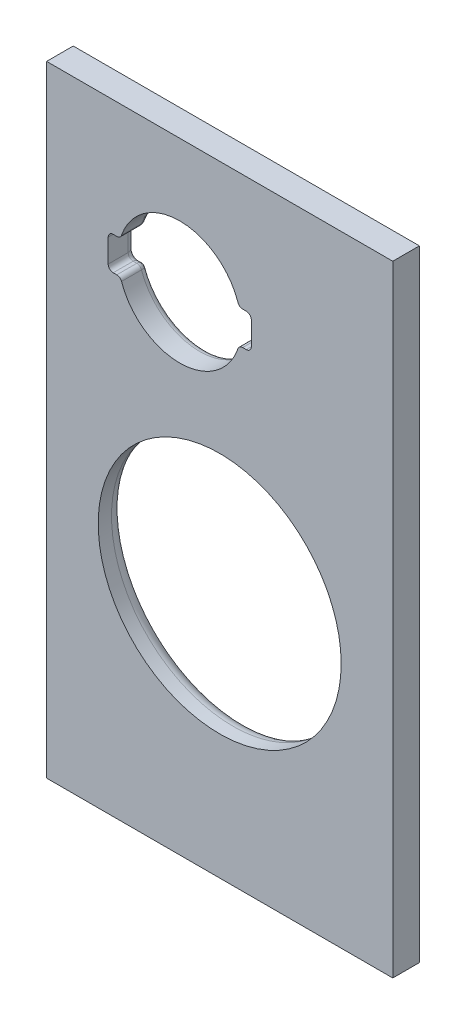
ISO-10303-21;
HEADER;
FILE_DESCRIPTION(('STEP AP214'),'2;1');
FILE_NAME('part.step','',(''),(''),'','','');
FILE_SCHEMA(('AUTOMOTIVE_DESIGN { 1 0 10303 214 1 1 1 1 }'));
ENDSEC;
DATA;
#1=APPLICATION_CONTEXT('core data for automotive mechanical design processes');
#2=APPLICATION_PROTOCOL_DEFINITION('international standard','automotive_design',2000,#1);
#3=PRODUCT_CONTEXT('',#1,'mechanical');
#4=PRODUCT('Part','Part','',(#3));
#5=PRODUCT_RELATED_PRODUCT_CATEGORY('part','',(#4));
#6=PRODUCT_DEFINITION_FORMATION('','',#4);
#7=PRODUCT_DEFINITION_CONTEXT('part definition',#1,'design');
#8=PRODUCT_DEFINITION('design','',#6,#7);
#9=PRODUCT_DEFINITION_SHAPE('','',#8);
#10=(LENGTH_UNIT() NAMED_UNIT(*) SI_UNIT(.MILLI.,.METRE.));
#11=(NAMED_UNIT(*) PLANE_ANGLE_UNIT() SI_UNIT($,.RADIAN.));
#12=(NAMED_UNIT(*) SI_UNIT($,.STERADIAN.) SOLID_ANGLE_UNIT());
#13=UNCERTAINTY_MEASURE_WITH_UNIT(LENGTH_MEASURE(1.E-05),#10,'distance_accuracy_value','');
#14=(GEOMETRIC_REPRESENTATION_CONTEXT(3) GLOBAL_UNCERTAINTY_ASSIGNED_CONTEXT((#13)) GLOBAL_UNIT_ASSIGNED_CONTEXT((#10,
#11,#12)) REPRESENTATION_CONTEXT('',''));
#15=CARTESIAN_POINT('',(0.,0.,0.));
#16=DIRECTION('',(0.,0.,1.));
#17=DIRECTION('',(1.,0.,0.));
#18=AXIS2_PLACEMENT_3D('',#15,#16,#17);
#19=CARTESIAN_POINT('',(104.,186.5,16.));
#20=DIRECTION('',(-1.,0.,0.));
#21=DIRECTION('',(0.,-1.,0.));
#22=AXIS2_PLACEMENT_3D('',#19,#20,#21);
#23=PLANE('',#22);
#24=DIRECTION('',(0.,1.,0.));
#25=VECTOR('',#24,1.);
#26=CARTESIAN_POINT('',(104.,186.5,0.));
#27=LINE('',#26,#25);
#28=CARTESIAN_POINT('',(104.,-186.5,0.));
#29=VERTEX_POINT('',#28);
#30=CARTESIAN_POINT('',(104.,186.5,0.));
#31=VERTEX_POINT('',#30);
#32=EDGE_CURVE('E280',#29,#31,#27,.T.);
#33=ORIENTED_EDGE('',*,*,#32,.T.);
#34=DIRECTION('',(0.,0.,-1.));
#35=VECTOR('',#34,1.);
#36=CARTESIAN_POINT('',(104.,186.5,16.));
#37=LINE('',#36,#35);
#38=CARTESIAN_POINT('',(104.,186.5,16.));
#39=VERTEX_POINT('',#38);
#40=EDGE_CURVE('E333',#39,#31,#37,.T.);
#41=ORIENTED_EDGE('',*,*,#40,.F.);
#42=DIRECTION('',(0.,1.,0.));
#43=VECTOR('',#42,1.);
#44=CARTESIAN_POINT('',(104.,186.5,16.));
#45=LINE('',#44,#43);
#46=CARTESIAN_POINT('',(104.,-186.5,16.));
#47=VERTEX_POINT('',#46);
#48=EDGE_CURVE('E307',#47,#39,#45,.T.);
#49=ORIENTED_EDGE('',*,*,#48,.F.);
#50=DIRECTION('',(0.,0.,-1.));
#51=VECTOR('',#50,1.);
#52=CARTESIAN_POINT('',(104.,-186.5,16.));
#53=LINE('',#52,#51);
#54=EDGE_CURVE('E317',#47,#29,#53,.T.);
#55=ORIENTED_EDGE('',*,*,#54,.T.);
#56=EDGE_LOOP('',(#33,#41,#49,#55));
#57=FACE_BOUND('',#56,.T.);
#58=ADVANCED_FACE('F31',(#57),#23,.F.);
#59=CARTESIAN_POINT('',(-104.,186.5,16.));
#60=DIRECTION('',(0.,-1.,0.));
#61=DIRECTION('',(0.,0.,-1.));
#62=AXIS2_PLACEMENT_3D('',#59,#60,#61);
#63=PLANE('',#62);
#64=DIRECTION('',(-1.,0.,0.));
#65=VECTOR('',#64,1.);
#66=CARTESIAN_POINT('',(-104.,186.5,0.));
#67=LINE('',#66,#65);
#68=CARTESIAN_POINT('',(-104.,186.5,0.));
#69=VERTEX_POINT('',#68);
#70=EDGE_CURVE('E320',#31,#69,#67,.T.);
#71=ORIENTED_EDGE('',*,*,#70,.T.);
#72=DIRECTION('',(0.,0.,-1.));
#73=VECTOR('',#72,1.);
#74=CARTESIAN_POINT('',(-104.,186.5,16.));
#75=LINE('',#74,#73);
#76=CARTESIAN_POINT('',(-104.,186.5,16.));
#77=VERTEX_POINT('',#76);
#78=EDGE_CURVE('E330',#77,#69,#75,.T.);
#79=ORIENTED_EDGE('',*,*,#78,.F.);
#80=DIRECTION('',(-1.,0.,0.));
#81=VECTOR('',#80,1.);
#82=CARTESIAN_POINT('',(-104.,186.5,16.));
#83=LINE('',#82,#81);
#84=EDGE_CURVE('E310',#39,#77,#83,.T.);
#85=ORIENTED_EDGE('',*,*,#84,.F.);
#86=ORIENTED_EDGE('',*,*,#40,.T.);
#87=EDGE_LOOP('',(#71,#79,#85,#86));
#88=FACE_BOUND('',#87,.T.);
#89=ADVANCED_FACE('F608',(#88),#63,.F.);
#90=CARTESIAN_POINT('',(-104.,186.5,16.));
#91=DIRECTION('',(1.,0.,0.));
#92=DIRECTION('',(0.,1.,0.));
#93=AXIS2_PLACEMENT_3D('',#90,#91,#92);
#94=PLANE('',#93);
#95=DIRECTION('',(0.,-1.,0.));
#96=VECTOR('',#95,1.);
#97=CARTESIAN_POINT('',(-104.,186.5,0.));
#98=LINE('',#97,#96);
#99=CARTESIAN_POINT('',(-104.,-186.5,0.));
#100=VERTEX_POINT('',#99);
#101=EDGE_CURVE('E322',#69,#100,#98,.T.);
#102=ORIENTED_EDGE('',*,*,#101,.T.);
#103=DIRECTION('',(0.,0.,-1.));
#104=VECTOR('',#103,1.);
#105=CARTESIAN_POINT('',(-104.,-186.5,16.));
#106=LINE('',#105,#104);
#107=CARTESIAN_POINT('',(-104.,-186.5,16.));
#108=VERTEX_POINT('',#107);
#109=EDGE_CURVE('E327',#108,#100,#106,.T.);
#110=ORIENTED_EDGE('',*,*,#109,.F.);
#111=DIRECTION('',(0.,-1.,0.));
#112=VECTOR('',#111,1.);
#113=CARTESIAN_POINT('',(-104.,186.5,16.));
#114=LINE('',#113,#112);
#115=EDGE_CURVE('E313',#77,#108,#114,.T.);
#116=ORIENTED_EDGE('',*,*,#115,.F.);
#117=ORIENTED_EDGE('',*,*,#78,.T.);
#118=EDGE_LOOP('',(#102,#110,#116,#117));
#119=FACE_BOUND('',#118,.T.);
#120=ADVANCED_FACE('F603',(#119),#94,.F.);
#121=CARTESIAN_POINT('',(-104.,-186.5,16.));
#122=DIRECTION('',(0.,1.,0.));
#123=DIRECTION('',(0.,0.,1.));
#124=AXIS2_PLACEMENT_3D('',#121,#122,#123);
#125=PLANE('',#124);
#126=DIRECTION('',(1.,0.,0.));
#127=VECTOR('',#126,1.);
#128=CARTESIAN_POINT('',(-104.,-186.5,0.));
#129=LINE('',#128,#127);
#130=EDGE_CURVE('E311',#100,#29,#129,.T.);
#131=ORIENTED_EDGE('',*,*,#130,.T.);
#132=ORIENTED_EDGE('',*,*,#54,.F.);
#133=DIRECTION('',(1.,0.,0.));
#134=VECTOR('',#133,1.);
#135=CARTESIAN_POINT('',(-104.,-186.5,16.));
#136=LINE('',#135,#134);
#137=EDGE_CURVE('E315',#108,#47,#136,.T.);
#138=ORIENTED_EDGE('',*,*,#137,.F.);
#139=ORIENTED_EDGE('',*,*,#109,.T.);
#140=EDGE_LOOP('',(#131,#132,#138,#139));
#141=FACE_BOUND('',#140,.T.);
#142=ADVANCED_FACE('F594',(#141),#125,.F.);
#143=CARTESIAN_POINT('',(104.,-186.5,16.));
#144=DIRECTION('',(0.,0.,1.));
#145=DIRECTION('',(1.,0.,0.));
#146=AXIS2_PLACEMENT_3D('',#143,#144,#145);
#147=PLANE('',#146);
#148=CARTESIAN_POINT('',(0.,-38.497326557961,16.));
#149=DIRECTION('',(0.,0.,1.));
#150=DIRECTION('',(1.,0.,0.));
#151=AXIS2_PLACEMENT_3D('',#148,#149,#150);
#152=CIRCLE('',#151,73.);
#153=CARTESIAN_POINT('',(73.0000000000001,-38.497326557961,16.));
#154=VERTEX_POINT('',#153);
#155=EDGE_CURVE('E559',#154,#154,#152,.T.);
#156=ORIENTED_EDGE('',*,*,#155,.F.);
#157=EDGE_LOOP('',(#156));
#158=FACE_BOUND('',#157,.T.);
#159=CARTESIAN_POINT('',(-63.9999999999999,113.502673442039,16.));
#160=DIRECTION('',(0.,0.,1.));
#161=DIRECTION('',(-1.,0.,0.));
#162=AXIS2_PLACEMENT_3D('',#159,#160,#161);
#163=CIRCLE('',#162,3.);
#164=CARTESIAN_POINT('',(-63.9999999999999,116.502673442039,16.));
#165=VERTEX_POINT('',#164);
#166=CARTESIAN_POINT('',(-66.9999999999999,113.502673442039,16.));
#167=VERTEX_POINT('',#166);
#168=EDGE_CURVE('E231',#165,#167,#163,.T.);
#169=ORIENTED_EDGE('',*,*,#168,.F.);
#170=DIRECTION('',(-1.,0.,0.));
#171=VECTOR('',#170,1.);
#172=CARTESIAN_POINT('',(-63.9999999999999,116.502673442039,16.));
#173=LINE('',#172,#171);
#174=CARTESIAN_POINT('',(-61.8285606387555,116.502673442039,16.));
#175=VERTEX_POINT('',#174);
#176=EDGE_CURVE('E275',#175,#165,#173,.T.);
#177=ORIENTED_EDGE('',*,*,#176,.F.);
#178=CARTESIAN_POINT('',(-61.8285606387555,119.502673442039,16.));
#179=DIRECTION('',(0.,0.,-1.));
#180=DIRECTION('',(1.,0.,0.));
#181=AXIS2_PLACEMENT_3D('',#178,#179,#180);
#182=CIRCLE('',#181,3.00000000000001);
#183=CARTESIAN_POINT('',(-58.9914185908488,118.527673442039,16.));
#184=VERTEX_POINT('',#183);
#185=EDGE_CURVE('E272',#184,#175,#182,.T.);
#186=ORIENTED_EDGE('',*,*,#185,.F.);
#187=CARTESIAN_POINT('',(-24.,106.502673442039,16.));
#188=DIRECTION('',(0.,0.,1.));
#189=DIRECTION('',(1.,0.,0.));
#190=AXIS2_PLACEMENT_3D('',#187,#188,#189);
#191=CIRCLE('',#190,37.);
#192=CARTESIAN_POINT('',(10.9914185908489,118.527673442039,16.));
#193=VERTEX_POINT('',#192);
#194=EDGE_CURVE('E269',#193,#184,#191,.T.);
#195=ORIENTED_EDGE('',*,*,#194,.F.);
#196=CARTESIAN_POINT('',(13.8285606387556,119.502673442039,16.));
#197=DIRECTION('',(0.,0.,-1.));
#198=DIRECTION('',(-1.,0.,0.));
#199=AXIS2_PLACEMENT_3D('',#196,#197,#198);
#200=CIRCLE('',#199,3.);
#201=CARTESIAN_POINT('',(13.8285606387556,116.502673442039,16.));
#202=VERTEX_POINT('',#201);
#203=EDGE_CURVE('E266',#202,#193,#200,.T.);
#204=ORIENTED_EDGE('',*,*,#203,.F.);
#205=DIRECTION('',(-1.,0.,0.));
#206=VECTOR('',#205,1.);
#207=CARTESIAN_POINT('',(13.8285606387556,116.502673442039,16.));
#208=LINE('',#207,#206);
#209=CARTESIAN_POINT('',(16.,116.502673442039,16.));
#210=VERTEX_POINT('',#209);
#211=EDGE_CURVE('E263',#210,#202,#208,.T.);
#212=ORIENTED_EDGE('',*,*,#211,.F.);
#213=CARTESIAN_POINT('',(16.,113.502673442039,16.));
#214=DIRECTION('',(0.,0.,1.));
#215=DIRECTION('',(1.,0.,0.));
#216=AXIS2_PLACEMENT_3D('',#213,#214,#215);
#217=CIRCLE('',#216,3.);
#218=CARTESIAN_POINT('',(19.,113.502673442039,16.));
#219=VERTEX_POINT('',#218);
#220=EDGE_CURVE('E260',#219,#210,#217,.T.);
#221=ORIENTED_EDGE('',*,*,#220,.F.);
#222=DIRECTION('',(0.,1.,0.));
#223=VECTOR('',#222,1.);
#224=CARTESIAN_POINT('',(19.,113.502673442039,16.));
#225=LINE('',#224,#223);
#226=CARTESIAN_POINT('',(19.,99.502673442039,16.));
#227=VERTEX_POINT('',#226);
#228=EDGE_CURVE('E257',#227,#219,#225,.T.);
#229=ORIENTED_EDGE('',*,*,#228,.F.);
#230=CARTESIAN_POINT('',(16.,99.502673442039,16.));
#231=DIRECTION('',(0.,0.,1.));
#232=DIRECTION('',(1.,0.,0.));
#233=AXIS2_PLACEMENT_3D('',#230,#231,#232);
#234=CIRCLE('',#233,3.);
#235=CARTESIAN_POINT('',(16.,96.502673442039,16.));
#236=VERTEX_POINT('',#235);
#237=EDGE_CURVE('E254',#236,#227,#234,.T.);
#238=ORIENTED_EDGE('',*,*,#237,.F.);
#239=DIRECTION('',(1.,0.,0.));
#240=VECTOR('',#239,1.);
#241=CARTESIAN_POINT('',(16.,96.502673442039,16.));
#242=LINE('',#241,#240);
#243=CARTESIAN_POINT('',(13.8285606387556,96.502673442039,16.));
#244=VERTEX_POINT('',#243);
#245=EDGE_CURVE('E251',#244,#236,#242,.T.);
#246=ORIENTED_EDGE('',*,*,#245,.F.);
#247=CARTESIAN_POINT('',(13.8285606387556,93.502673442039,16.));
#248=DIRECTION('',(0.,0.,-1.));
#249=DIRECTION('',(1.,0.,0.));
#250=AXIS2_PLACEMENT_3D('',#247,#248,#249);
#251=CIRCLE('',#250,3.);
#252=CARTESIAN_POINT('',(10.9914185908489,94.477673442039,16.));
#253=VERTEX_POINT('',#252);
#254=EDGE_CURVE('E248',#253,#244,#251,.T.);
#255=ORIENTED_EDGE('',*,*,#254,.F.);
#256=CARTESIAN_POINT('',(-24.,106.502673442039,16.));
#257=DIRECTION('',(0.,0.,1.));
#258=DIRECTION('',(1.,0.,0.));
#259=AXIS2_PLACEMENT_3D('',#256,#257,#258);
#260=CIRCLE('',#259,37.);
#261=CARTESIAN_POINT('',(-58.9914185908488,94.477673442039,16.));
#262=VERTEX_POINT('',#261);
#263=EDGE_CURVE('E245',#262,#253,#260,.T.);
#264=ORIENTED_EDGE('',*,*,#263,.F.);
#265=CARTESIAN_POINT('',(-61.8285606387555,93.502673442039,16.));
#266=DIRECTION('',(0.,0.,-1.));
#267=DIRECTION('',(1.,0.,0.));
#268=AXIS2_PLACEMENT_3D('',#265,#266,#267);
#269=CIRCLE('',#268,3.00000000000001);
#270=CARTESIAN_POINT('',(-61.8285606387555,96.502673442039,16.));
#271=VERTEX_POINT('',#270);
#272=EDGE_CURVE('E239',#271,#262,#269,.T.);
#273=ORIENTED_EDGE('',*,*,#272,.F.);
#274=DIRECTION('',(1.,0.,0.));
#275=VECTOR('',#274,1.);
#276=CARTESIAN_POINT('',(-61.8285606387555,96.502673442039,16.));
#277=LINE('',#276,#275);
#278=CARTESIAN_POINT('',(-63.9999999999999,96.502673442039,16.));
#279=VERTEX_POINT('',#278);
#280=EDGE_CURVE('E237',#279,#271,#277,.T.);
#281=ORIENTED_EDGE('',*,*,#280,.F.);
#282=CARTESIAN_POINT('',(-63.9999999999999,99.502673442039,16.));
#283=DIRECTION('',(0.,0.,1.));
#284=DIRECTION('',(-1.,0.,0.));
#285=AXIS2_PLACEMENT_3D('',#282,#283,#284);
#286=CIRCLE('',#285,3.);
#287=CARTESIAN_POINT('',(-66.9999999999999,99.502673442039,16.));
#288=VERTEX_POINT('',#287);
#289=EDGE_CURVE('E215',#288,#279,#286,.T.);
#290=ORIENTED_EDGE('',*,*,#289,.F.);
#291=DIRECTION('',(0.,-1.,0.));
#292=VECTOR('',#291,1.);
#293=CARTESIAN_POINT('',(-66.9999999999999,113.502673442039,16.));
#294=LINE('',#293,#292);
#295=EDGE_CURVE('E225',#167,#288,#294,.T.);
#296=ORIENTED_EDGE('',*,*,#295,.F.);
#297=EDGE_LOOP('',(#169,#177,#186,#195,#204,#212,#221,#229,#238,#246,#255,#264,#273,#281,#290,#296));
#298=FACE_BOUND('',#297,.T.);
#299=ORIENTED_EDGE('',*,*,#48,.T.);
#300=ORIENTED_EDGE('',*,*,#84,.T.);
#301=ORIENTED_EDGE('',*,*,#115,.T.);
#302=ORIENTED_EDGE('',*,*,#137,.T.);
#303=EDGE_LOOP('',(#299,#300,#301,#302));
#304=FACE_BOUND('',#303,.T.);
#305=ADVANCED_FACE('F233',(#158,#298,#304),#147,.T.);
#306=CARTESIAN_POINT('',(104.,-186.5,0.));
#307=DIRECTION('',(0.,0.,1.));
#308=DIRECTION('',(1.,0.,0.));
#309=AXIS2_PLACEMENT_3D('',#306,#307,#308);
#310=PLANE('',#309);
#311=CARTESIAN_POINT('',(16.,113.502673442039,0.));
#312=DIRECTION('',(0.,0.,1.));
#313=DIRECTION('',(1.,0.,0.));
#314=AXIS2_PLACEMENT_3D('',#311,#312,#313);
#315=CIRCLE('',#314,7.);
#316=CARTESIAN_POINT('',(23.,113.502673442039,0.));
#317=VERTEX_POINT('',#316);
#318=CARTESIAN_POINT('',(16.,120.502673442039,0.));
#319=VERTEX_POINT('',#318);
#320=EDGE_CURVE('E365',#317,#319,#315,.T.);
#321=ORIENTED_EDGE('',*,*,#320,.T.);
#322=DIRECTION('',(-1.,0.,0.));
#323=VECTOR('',#322,1.);
#324=CARTESIAN_POINT('',(104.,120.502673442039,0.));
#325=LINE('',#324,#323);
#326=CARTESIAN_POINT('',(14.5356977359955,120.502673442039,0.));
#327=VERTEX_POINT('',#326);
#328=EDGE_CURVE('E367',#319,#327,#325,.T.);
#329=ORIENTED_EDGE('',*,*,#328,.T.);
#330=CARTESIAN_POINT('',(-24.,106.502673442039,0.));
#331=DIRECTION('',(0.,0.,1.));
#332=DIRECTION('',(1.,0.,0.));
#333=AXIS2_PLACEMENT_3D('',#330,#331,#332);
#334=CIRCLE('',#333,41.);
#335=CARTESIAN_POINT('',(-62.5356977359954,120.502673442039,0.));
#336=VERTEX_POINT('',#335);
#337=EDGE_CURVE('E345',#327,#336,#334,.T.);
#338=ORIENTED_EDGE('',*,*,#337,.T.);
#339=DIRECTION('',(-1.,0.,0.));
#340=VECTOR('',#339,1.);
#341=CARTESIAN_POINT('',(104.,120.502673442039,0.));
#342=LINE('',#341,#340);
#343=CARTESIAN_POINT('',(-63.9999999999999,120.502673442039,0.));
#344=VERTEX_POINT('',#343);
#345=EDGE_CURVE('E347',#336,#344,#342,.T.);
#346=ORIENTED_EDGE('',*,*,#345,.T.);
#347=CARTESIAN_POINT('',(-63.9999999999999,113.502673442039,0.));
#348=DIRECTION('',(0.,0.,1.));
#349=DIRECTION('',(1.,0.,0.));
#350=AXIS2_PLACEMENT_3D('',#347,#348,#349);
#351=CIRCLE('',#350,7.);
#352=CARTESIAN_POINT('',(-71.,113.502673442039,0.));
#353=VERTEX_POINT('',#352);
#354=EDGE_CURVE('E349',#344,#353,#351,.T.);
#355=ORIENTED_EDGE('',*,*,#354,.T.);
#356=DIRECTION('',(0.,-1.,0.));
#357=VECTOR('',#356,1.);
#358=CARTESIAN_POINT('',(-71.,-186.5,0.));
#359=LINE('',#358,#357);
#360=CARTESIAN_POINT('',(-71.,99.5026734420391,0.));
#361=VERTEX_POINT('',#360);
#362=EDGE_CURVE('E351',#353,#361,#359,.T.);
#363=ORIENTED_EDGE('',*,*,#362,.T.);
#364=CARTESIAN_POINT('',(-63.9999999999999,99.502673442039,0.));
#365=DIRECTION('',(0.,0.,1.));
#366=DIRECTION('',(1.,0.,0.));
#367=AXIS2_PLACEMENT_3D('',#364,#365,#366);
#368=CIRCLE('',#367,7.);
#369=CARTESIAN_POINT('',(-63.9999999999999,92.502673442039,0.));
#370=VERTEX_POINT('',#369);
#371=EDGE_CURVE('E353',#361,#370,#368,.T.);
#372=ORIENTED_EDGE('',*,*,#371,.T.);
#373=DIRECTION('',(1.,0.,0.));
#374=VECTOR('',#373,1.);
#375=CARTESIAN_POINT('',(104.,92.502673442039,0.));
#376=LINE('',#375,#374);
#377=CARTESIAN_POINT('',(-62.5356977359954,92.502673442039,0.));
#378=VERTEX_POINT('',#377);
#379=EDGE_CURVE('E355',#370,#378,#376,.T.);
#380=ORIENTED_EDGE('',*,*,#379,.T.);
#381=CARTESIAN_POINT('',(-24.,106.502673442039,0.));
#382=DIRECTION('',(0.,0.,1.));
#383=DIRECTION('',(1.,0.,0.));
#384=AXIS2_PLACEMENT_3D('',#381,#382,#383);
#385=CIRCLE('',#384,41.);
#386=CARTESIAN_POINT('',(14.5356977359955,92.502673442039,0.));
#387=VERTEX_POINT('',#386);
#388=EDGE_CURVE('E357',#378,#387,#385,.T.);
#389=ORIENTED_EDGE('',*,*,#388,.T.);
#390=DIRECTION('',(1.,0.,0.));
#391=VECTOR('',#390,1.);
#392=CARTESIAN_POINT('',(104.,92.502673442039,0.));
#393=LINE('',#392,#391);
#394=CARTESIAN_POINT('',(16.,92.502673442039,0.));
#395=VERTEX_POINT('',#394);
#396=EDGE_CURVE('E359',#387,#395,#393,.T.);
#397=ORIENTED_EDGE('',*,*,#396,.T.);
#398=CARTESIAN_POINT('',(16.,99.502673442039,0.));
#399=DIRECTION('',(0.,0.,1.));
#400=DIRECTION('',(1.,0.,0.));
#401=AXIS2_PLACEMENT_3D('',#398,#399,#400);
#402=CIRCLE('',#401,7.);
#403=CARTESIAN_POINT('',(23.,99.502673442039,0.));
#404=VERTEX_POINT('',#403);
#405=EDGE_CURVE('E361',#395,#404,#402,.T.);
#406=ORIENTED_EDGE('',*,*,#405,.T.);
#407=DIRECTION('',(0.,1.,0.));
#408=VECTOR('',#407,1.);
#409=CARTESIAN_POINT('',(23.,-186.5,0.));
#410=LINE('',#409,#408);
#411=EDGE_CURVE('E363',#404,#317,#410,.T.);
#412=ORIENTED_EDGE('',*,*,#411,.T.);
#413=EDGE_LOOP('',(#321,#329,#338,#346,#355,#363,#372,#380,#389,#397,#406,#412));
#414=FACE_BOUND('',#413,.T.);
#415=CARTESIAN_POINT('',(0.,-38.497326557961,0.));
#416=DIRECTION('',(0.,0.,1.));
#417=DIRECTION('',(1.,0.,0.));
#418=AXIS2_PLACEMENT_3D('',#415,#416,#417);
#419=CIRCLE('',#418,81.);
#420=CARTESIAN_POINT('',(81.0000000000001,-38.497326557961,0.));
#421=VERTEX_POINT('',#420);
#422=EDGE_CURVE('E336',#421,#421,#419,.T.);
#423=ORIENTED_EDGE('',*,*,#422,.T.);
#424=EDGE_LOOP('',(#423));
#425=FACE_BOUND('',#424,.T.);
#426=ORIENTED_EDGE('',*,*,#32,.F.);
#427=ORIENTED_EDGE('',*,*,#130,.F.);
#428=ORIENTED_EDGE('',*,*,#101,.F.);
#429=ORIENTED_EDGE('',*,*,#70,.F.);
#430=EDGE_LOOP('',(#426,#427,#428,#429));
#431=FACE_BOUND('',#430,.T.);
#432=ADVANCED_FACE('F570',(#414,#425,#431),#310,.F.);
#433=CARTESIAN_POINT('',(-63.9999999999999,113.502673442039,0.));
#434=DIRECTION('',(0.,0.,1.));
#435=DIRECTION('',(1.,0.,0.));
#436=AXIS2_PLACEMENT_3D('',#433,#434,#435);
#437=CYLINDRICAL_SURFACE('',#436,3.);
#438=DIRECTION('',(0.,0.,1.));
#439=VECTOR('',#438,1.);
#440=CARTESIAN_POINT('',(-66.9999999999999,113.502673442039,0.));
#441=LINE('',#440,#439);
#442=CARTESIAN_POINT('',(-66.9999999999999,113.502673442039,4.));
#443=VERTEX_POINT('',#442);
#444=EDGE_CURVE('E222',#443,#167,#441,.T.);
#445=ORIENTED_EDGE('',*,*,#444,.F.);
#446=CARTESIAN_POINT('',(-63.9999999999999,113.502673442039,4.));
#447=DIRECTION('',(0.,0.,1.));
#448=DIRECTION('',(1.,0.,0.));
#449=AXIS2_PLACEMENT_3D('',#446,#447,#448);
#450=CIRCLE('',#449,3.);
#451=CARTESIAN_POINT('',(-63.9999999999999,116.502673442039,4.));
#452=VERTEX_POINT('',#451);
#453=EDGE_CURVE('E391',#443,#452,#450,.F.);
#454=ORIENTED_EDGE('',*,*,#453,.T.);
#455=DIRECTION('',(0.,0.,1.));
#456=VECTOR('',#455,1.);
#457=CARTESIAN_POINT('',(-63.9999999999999,116.502673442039,0.));
#458=LINE('',#457,#456);
#459=EDGE_CURVE('E278',#452,#165,#458,.T.);
#460=ORIENTED_EDGE('',*,*,#459,.T.);
#461=ORIENTED_EDGE('',*,*,#168,.T.);
#462=EDGE_LOOP('',(#445,#454,#460,#461));
#463=FACE_BOUND('',#462,.T.);
#464=ADVANCED_FACE('F583',(#463),#437,.F.);
#465=CARTESIAN_POINT('',(-63.9999999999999,116.502673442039,0.));
#466=DIRECTION('',(0.,1.,0.));
#467=DIRECTION('',(0.,0.,1.));
#468=AXIS2_PLACEMENT_3D('',#465,#466,#467);
#469=PLANE('',#468);
#470=ORIENTED_EDGE('',*,*,#459,.F.);
#471=DIRECTION('',(-1.,0.,0.));
#472=VECTOR('',#471,1.);
#473=CARTESIAN_POINT('',(-63.9999999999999,116.502673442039,4.));
#474=LINE('',#473,#472);
#475=CARTESIAN_POINT('',(-61.8285606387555,116.502673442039,4.));
#476=VERTEX_POINT('',#475);
#477=EDGE_CURVE('E60',#452,#476,#474,.F.);
#478=ORIENTED_EDGE('',*,*,#477,.T.);
#479=DIRECTION('',(0.,0.,1.));
#480=VECTOR('',#479,1.);
#481=CARTESIAN_POINT('',(-61.8285606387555,116.502673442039,0.));
#482=LINE('',#481,#480);
#483=EDGE_CURVE('E281',#476,#175,#482,.T.);
#484=ORIENTED_EDGE('',*,*,#483,.T.);
#485=ORIENTED_EDGE('',*,*,#176,.T.);
#486=EDGE_LOOP('',(#470,#478,#484,#485));
#487=FACE_BOUND('',#486,.T.);
#488=ADVANCED_FACE('F584',(#487),#469,.F.);
#489=CARTESIAN_POINT('',(-61.8285606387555,119.502673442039,0.));
#490=DIRECTION('',(0.,0.,1.));
#491=DIRECTION('',(1.,0.,0.));
#492=AXIS2_PLACEMENT_3D('',#489,#490,#491);
#493=CYLINDRICAL_SURFACE('',#492,3.00000000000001);
#494=ORIENTED_EDGE('',*,*,#483,.F.);
#495=CARTESIAN_POINT('',(-61.8285606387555,119.502673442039,4.));
#496=DIRECTION('',(0.,0.,1.));
#497=DIRECTION('',(1.,0.,0.));
#498=AXIS2_PLACEMENT_3D('',#495,#496,#497);
#499=CIRCLE('',#498,3.00000000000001);
#500=CARTESIAN_POINT('',(-58.9914185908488,118.527673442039,4.));
#501=VERTEX_POINT('',#500);
#502=EDGE_CURVE('E45',#476,#501,#499,.T.);
#503=ORIENTED_EDGE('',*,*,#502,.T.);
#504=DIRECTION('',(0.,0.,1.));
#505=VECTOR('',#504,1.);
#506=CARTESIAN_POINT('',(-58.9914185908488,118.527673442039,0.));
#507=LINE('',#506,#505);
#508=EDGE_CURVE('E283',#501,#184,#507,.T.);
#509=ORIENTED_EDGE('',*,*,#508,.T.);
#510=ORIENTED_EDGE('',*,*,#185,.T.);
#511=EDGE_LOOP('',(#494,#503,#509,#510));
#512=FACE_BOUND('',#511,.T.);
#513=ADVANCED_FACE('F668',(#512),#493,.T.);
#514=CARTESIAN_POINT('',(-24.,106.502673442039,0.));
#515=DIRECTION('',(0.,0.,1.));
#516=DIRECTION('',(1.,0.,0.));
#517=AXIS2_PLACEMENT_3D('',#514,#515,#516);
#518=CYLINDRICAL_SURFACE('',#517,37.);
#519=ORIENTED_EDGE('',*,*,#508,.F.);
#520=CARTESIAN_POINT('',(-24.,106.502673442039,4.));
#521=DIRECTION('',(0.,0.,1.));
#522=DIRECTION('',(1.,0.,0.));
#523=AXIS2_PLACEMENT_3D('',#520,#521,#522);
#524=CIRCLE('',#523,37.);
#525=CARTESIAN_POINT('',(10.9914185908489,118.527673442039,4.));
#526=VERTEX_POINT('',#525);
#527=EDGE_CURVE('E11',#501,#526,#524,.F.);
#528=ORIENTED_EDGE('',*,*,#527,.T.);
#529=DIRECTION('',(0.,0.,1.));
#530=VECTOR('',#529,1.);
#531=CARTESIAN_POINT('',(10.9914185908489,118.527673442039,0.));
#532=LINE('',#531,#530);
#533=EDGE_CURVE('E285',#526,#193,#532,.T.);
#534=ORIENTED_EDGE('',*,*,#533,.T.);
#535=ORIENTED_EDGE('',*,*,#194,.T.);
#536=EDGE_LOOP('',(#519,#528,#534,#535));
#537=FACE_BOUND('',#536,.T.);
#538=ADVANCED_FACE('F675',(#537),#518,.F.);
#539=CARTESIAN_POINT('',(13.8285606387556,119.502673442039,0.));
#540=DIRECTION('',(0.,0.,1.));
#541=DIRECTION('',(1.,0.,0.));
#542=AXIS2_PLACEMENT_3D('',#539,#540,#541);
#543=CYLINDRICAL_SURFACE('',#542,3.);
#544=ORIENTED_EDGE('',*,*,#533,.F.);
#545=CARTESIAN_POINT('',(13.8285606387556,119.502673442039,4.));
#546=DIRECTION('',(0.,0.,1.));
#547=DIRECTION('',(1.,0.,0.));
#548=AXIS2_PLACEMENT_3D('',#545,#546,#547);
#549=CIRCLE('',#548,3.);
#550=CARTESIAN_POINT('',(13.8285606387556,116.502673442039,4.));
#551=VERTEX_POINT('',#550);
#552=EDGE_CURVE('E342',#526,#551,#549,.T.);
#553=ORIENTED_EDGE('',*,*,#552,.T.);
#554=DIRECTION('',(0.,0.,1.));
#555=VECTOR('',#554,1.);
#556=CARTESIAN_POINT('',(13.8285606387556,116.502673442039,0.));
#557=LINE('',#556,#555);
#558=EDGE_CURVE('E287',#551,#202,#557,.T.);
#559=ORIENTED_EDGE('',*,*,#558,.T.);
#560=ORIENTED_EDGE('',*,*,#203,.T.);
#561=EDGE_LOOP('',(#544,#553,#559,#560));
#562=FACE_BOUND('',#561,.T.);
#563=ADVANCED_FACE('F682',(#562),#543,.T.);
#564=CARTESIAN_POINT('',(13.8285606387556,116.502673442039,0.));
#565=DIRECTION('',(0.,1.,0.));
#566=DIRECTION('',(0.,0.,1.));
#567=AXIS2_PLACEMENT_3D('',#564,#565,#566);
#568=PLANE('',#567);
#569=ORIENTED_EDGE('',*,*,#558,.F.);
#570=DIRECTION('',(-1.,0.,0.));
#571=VECTOR('',#570,1.);
#572=CARTESIAN_POINT('',(13.8285606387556,116.502673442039,4.));
#573=LINE('',#572,#571);
#574=CARTESIAN_POINT('',(16.,116.502673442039,4.));
#575=VERTEX_POINT('',#574);
#576=EDGE_CURVE('E370',#551,#575,#573,.F.);
#577=ORIENTED_EDGE('',*,*,#576,.T.);
#578=DIRECTION('',(0.,0.,1.));
#579=VECTOR('',#578,1.);
#580=CARTESIAN_POINT('',(16.,116.502673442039,0.));
#581=LINE('',#580,#579);
#582=EDGE_CURVE('E289',#575,#210,#581,.T.);
#583=ORIENTED_EDGE('',*,*,#582,.T.);
#584=ORIENTED_EDGE('',*,*,#211,.T.);
#585=EDGE_LOOP('',(#569,#577,#583,#584));
#586=FACE_BOUND('',#585,.T.);
#587=ADVANCED_FACE('F690',(#586),#568,.F.);
#588=CARTESIAN_POINT('',(16.,113.502673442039,0.));
#589=DIRECTION('',(0.,0.,1.));
#590=DIRECTION('',(1.,0.,0.));
#591=AXIS2_PLACEMENT_3D('',#588,#589,#590);
#592=CYLINDRICAL_SURFACE('',#591,3.);
#593=ORIENTED_EDGE('',*,*,#582,.F.);
#594=CARTESIAN_POINT('',(16.,113.502673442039,4.));
#595=DIRECTION('',(0.,0.,1.));
#596=DIRECTION('',(1.,0.,0.));
#597=AXIS2_PLACEMENT_3D('',#594,#595,#596);
#598=CIRCLE('',#597,3.);
#599=CARTESIAN_POINT('',(19.,113.502673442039,4.));
#600=VERTEX_POINT('',#599);
#601=EDGE_CURVE('E372',#575,#600,#598,.F.);
#602=ORIENTED_EDGE('',*,*,#601,.T.);
#603=DIRECTION('',(0.,0.,1.));
#604=VECTOR('',#603,1.);
#605=CARTESIAN_POINT('',(19.,113.502673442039,0.));
#606=LINE('',#605,#604);
#607=EDGE_CURVE('E291',#600,#219,#606,.T.);
#608=ORIENTED_EDGE('',*,*,#607,.T.);
#609=ORIENTED_EDGE('',*,*,#220,.T.);
#610=EDGE_LOOP('',(#593,#602,#608,#609));
#611=FACE_BOUND('',#610,.T.);
#612=ADVANCED_FACE('F698',(#611),#592,.F.);
#613=CARTESIAN_POINT('',(19.,113.502673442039,0.));
#614=DIRECTION('',(1.,0.,0.));
#615=DIRECTION('',(0.,0.,-1.));
#616=AXIS2_PLACEMENT_3D('',#613,#614,#615);
#617=PLANE('',#616);
#618=ORIENTED_EDGE('',*,*,#607,.F.);
#619=DIRECTION('',(0.,1.,0.));
#620=VECTOR('',#619,1.);
#621=CARTESIAN_POINT('',(19.,113.502673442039,4.));
#622=LINE('',#621,#620);
#623=CARTESIAN_POINT('',(19.,99.502673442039,4.));
#624=VERTEX_POINT('',#623);
#625=EDGE_CURVE('E374',#600,#624,#622,.F.);
#626=ORIENTED_EDGE('',*,*,#625,.T.);
#627=DIRECTION('',(0.,0.,1.));
#628=VECTOR('',#627,1.);
#629=CARTESIAN_POINT('',(19.,99.502673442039,0.));
#630=LINE('',#629,#628);
#631=EDGE_CURVE('E293',#624,#227,#630,.T.);
#632=ORIENTED_EDGE('',*,*,#631,.T.);
#633=ORIENTED_EDGE('',*,*,#228,.T.);
#634=EDGE_LOOP('',(#618,#626,#632,#633));
#635=FACE_BOUND('',#634,.T.);
#636=ADVANCED_FACE('F706',(#635),#617,.F.);
#637=CARTESIAN_POINT('',(16.,99.502673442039,0.));
#638=DIRECTION('',(0.,0.,1.));
#639=DIRECTION('',(1.,0.,0.));
#640=AXIS2_PLACEMENT_3D('',#637,#638,#639);
#641=CYLINDRICAL_SURFACE('',#640,3.);
#642=ORIENTED_EDGE('',*,*,#631,.F.);
#643=CARTESIAN_POINT('',(16.,99.502673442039,4.));
#644=DIRECTION('',(0.,0.,1.));
#645=DIRECTION('',(1.,0.,0.));
#646=AXIS2_PLACEMENT_3D('',#643,#644,#645);
#647=CIRCLE('',#646,3.);
#648=CARTESIAN_POINT('',(16.,96.502673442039,4.));
#649=VERTEX_POINT('',#648);
#650=EDGE_CURVE('E376',#624,#649,#647,.F.);
#651=ORIENTED_EDGE('',*,*,#650,.T.);
#652=DIRECTION('',(0.,0.,1.));
#653=VECTOR('',#652,1.);
#654=CARTESIAN_POINT('',(16.,96.502673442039,0.));
#655=LINE('',#654,#653);
#656=EDGE_CURVE('E295',#649,#236,#655,.T.);
#657=ORIENTED_EDGE('',*,*,#656,.T.);
#658=ORIENTED_EDGE('',*,*,#237,.T.);
#659=EDGE_LOOP('',(#642,#651,#657,#658));
#660=FACE_BOUND('',#659,.T.);
#661=ADVANCED_FACE('F714',(#660),#641,.F.);
#662=CARTESIAN_POINT('',(16.,96.502673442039,0.));
#663=DIRECTION('',(0.,-1.,0.));
#664=DIRECTION('',(0.,0.,-1.));
#665=AXIS2_PLACEMENT_3D('',#662,#663,#664);
#666=PLANE('',#665);
#667=ORIENTED_EDGE('',*,*,#656,.F.);
#668=DIRECTION('',(1.,0.,0.));
#669=VECTOR('',#668,1.);
#670=CARTESIAN_POINT('',(16.,96.502673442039,4.));
#671=LINE('',#670,#669);
#672=CARTESIAN_POINT('',(13.8285606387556,96.502673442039,4.));
#673=VERTEX_POINT('',#672);
#674=EDGE_CURVE('E378',#649,#673,#671,.F.);
#675=ORIENTED_EDGE('',*,*,#674,.T.);
#676=DIRECTION('',(0.,0.,1.));
#677=VECTOR('',#676,1.);
#678=CARTESIAN_POINT('',(13.8285606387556,96.502673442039,0.));
#679=LINE('',#678,#677);
#680=EDGE_CURVE('E297',#673,#244,#679,.T.);
#681=ORIENTED_EDGE('',*,*,#680,.T.);
#682=ORIENTED_EDGE('',*,*,#245,.T.);
#683=EDGE_LOOP('',(#667,#675,#681,#682));
#684=FACE_BOUND('',#683,.T.);
#685=ADVANCED_FACE('F722',(#684),#666,.F.);
#686=CARTESIAN_POINT('',(13.8285606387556,93.502673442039,0.));
#687=DIRECTION('',(0.,0.,1.));
#688=DIRECTION('',(1.,0.,0.));
#689=AXIS2_PLACEMENT_3D('',#686,#687,#688);
#690=CYLINDRICAL_SURFACE('',#689,3.);
#691=ORIENTED_EDGE('',*,*,#680,.F.);
#692=CARTESIAN_POINT('',(13.8285606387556,93.502673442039,4.));
#693=DIRECTION('',(0.,0.,1.));
#694=DIRECTION('',(1.,0.,0.));
#695=AXIS2_PLACEMENT_3D('',#692,#693,#694);
#696=CIRCLE('',#695,3.);
#697=CARTESIAN_POINT('',(10.9914185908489,94.477673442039,4.));
#698=VERTEX_POINT('',#697);
#699=EDGE_CURVE('E380',#673,#698,#696,.T.);
#700=ORIENTED_EDGE('',*,*,#699,.T.);
#701=DIRECTION('',(0.,0.,1.));
#702=VECTOR('',#701,1.);
#703=CARTESIAN_POINT('',(10.9914185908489,94.477673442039,0.));
#704=LINE('',#703,#702);
#705=EDGE_CURVE('E299',#698,#253,#704,.T.);
#706=ORIENTED_EDGE('',*,*,#705,.T.);
#707=ORIENTED_EDGE('',*,*,#254,.T.);
#708=EDGE_LOOP('',(#691,#700,#706,#707));
#709=FACE_BOUND('',#708,.T.);
#710=ADVANCED_FACE('F730',(#709),#690,.T.);
#711=CARTESIAN_POINT('',(-24.,106.502673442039,0.));
#712=DIRECTION('',(0.,0.,1.));
#713=DIRECTION('',(1.,0.,0.));
#714=AXIS2_PLACEMENT_3D('',#711,#712,#713);
#715=CYLINDRICAL_SURFACE('',#714,37.);
#716=ORIENTED_EDGE('',*,*,#705,.F.);
#717=CARTESIAN_POINT('',(-24.,106.502673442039,4.));
#718=DIRECTION('',(0.,0.,1.));
#719=DIRECTION('',(1.,0.,0.));
#720=AXIS2_PLACEMENT_3D('',#717,#718,#719);
#721=CIRCLE('',#720,37.);
#722=CARTESIAN_POINT('',(-58.9914185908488,94.477673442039,4.));
#723=VERTEX_POINT('',#722);
#724=EDGE_CURVE('E382',#698,#723,#721,.F.);
#725=ORIENTED_EDGE('',*,*,#724,.T.);
#726=DIRECTION('',(0.,0.,1.));
#727=VECTOR('',#726,1.);
#728=CARTESIAN_POINT('',(-58.9914185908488,94.477673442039,0.));
#729=LINE('',#728,#727);
#730=EDGE_CURVE('E301',#723,#262,#729,.T.);
#731=ORIENTED_EDGE('',*,*,#730,.T.);
#732=ORIENTED_EDGE('',*,*,#263,.T.);
#733=EDGE_LOOP('',(#716,#725,#731,#732));
#734=FACE_BOUND('',#733,.T.);
#735=ADVANCED_FACE('F738',(#734),#715,.F.);
#736=CARTESIAN_POINT('',(-61.8285606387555,93.502673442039,0.));
#737=DIRECTION('',(0.,0.,1.));
#738=DIRECTION('',(1.,0.,0.));
#739=AXIS2_PLACEMENT_3D('',#736,#737,#738);
#740=CYLINDRICAL_SURFACE('',#739,3.00000000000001);
#741=ORIENTED_EDGE('',*,*,#730,.F.);
#742=CARTESIAN_POINT('',(-61.8285606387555,93.502673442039,4.));
#743=DIRECTION('',(0.,0.,1.));
#744=DIRECTION('',(1.,0.,0.));
#745=AXIS2_PLACEMENT_3D('',#742,#743,#744);
#746=CIRCLE('',#745,3.00000000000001);
#747=CARTESIAN_POINT('',(-61.8285606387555,96.502673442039,4.));
#748=VERTEX_POINT('',#747);
#749=EDGE_CURVE('E384',#723,#748,#746,.T.);
#750=ORIENTED_EDGE('',*,*,#749,.T.);
#751=DIRECTION('',(0.,0.,1.));
#752=VECTOR('',#751,1.);
#753=CARTESIAN_POINT('',(-61.8285606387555,96.502673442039,0.));
#754=LINE('',#753,#752);
#755=EDGE_CURVE('E303',#748,#271,#754,.T.);
#756=ORIENTED_EDGE('',*,*,#755,.T.);
#757=ORIENTED_EDGE('',*,*,#272,.T.);
#758=EDGE_LOOP('',(#741,#750,#756,#757));
#759=FACE_BOUND('',#758,.T.);
#760=ADVANCED_FACE('F746',(#759),#740,.T.);
#761=CARTESIAN_POINT('',(-61.8285606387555,96.502673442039,0.));
#762=DIRECTION('',(0.,-1.,0.));
#763=DIRECTION('',(0.,0.,-1.));
#764=AXIS2_PLACEMENT_3D('',#761,#762,#763);
#765=PLANE('',#764);
#766=ORIENTED_EDGE('',*,*,#755,.F.);
#767=DIRECTION('',(1.,0.,0.));
#768=VECTOR('',#767,1.);
#769=CARTESIAN_POINT('',(-61.8285606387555,96.502673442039,4.));
#770=LINE('',#769,#768);
#771=CARTESIAN_POINT('',(-63.9999999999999,96.502673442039,4.));
#772=VERTEX_POINT('',#771);
#773=EDGE_CURVE('E386',#748,#772,#770,.F.);
#774=ORIENTED_EDGE('',*,*,#773,.T.);
#775=DIRECTION('',(0.,0.,1.));
#776=VECTOR('',#775,1.);
#777=CARTESIAN_POINT('',(-63.9999999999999,96.502673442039,0.));
#778=LINE('',#777,#776);
#779=EDGE_CURVE('E221',#772,#279,#778,.T.);
#780=ORIENTED_EDGE('',*,*,#779,.T.);
#781=ORIENTED_EDGE('',*,*,#280,.T.);
#782=EDGE_LOOP('',(#766,#774,#780,#781));
#783=FACE_BOUND('',#782,.T.);
#784=ADVANCED_FACE('F754',(#783),#765,.F.);
#785=CARTESIAN_POINT('',(-63.9999999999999,99.502673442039,0.));
#786=DIRECTION('',(0.,0.,1.));
#787=DIRECTION('',(1.,0.,0.));
#788=AXIS2_PLACEMENT_3D('',#785,#786,#787);
#789=CYLINDRICAL_SURFACE('',#788,3.);
#790=ORIENTED_EDGE('',*,*,#779,.F.);
#791=CARTESIAN_POINT('',(-63.9999999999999,99.502673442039,4.));
#792=DIRECTION('',(0.,0.,1.));
#793=DIRECTION('',(1.,0.,0.));
#794=AXIS2_PLACEMENT_3D('',#791,#792,#793);
#795=CIRCLE('',#794,3.);
#796=CARTESIAN_POINT('',(-66.9999999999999,99.502673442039,4.));
#797=VERTEX_POINT('',#796);
#798=EDGE_CURVE('E218',#772,#797,#795,.F.);
#799=ORIENTED_EDGE('',*,*,#798,.T.);
#800=DIRECTION('',(0.,0.,1.));
#801=VECTOR('',#800,1.);
#802=CARTESIAN_POINT('',(-66.9999999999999,99.502673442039,0.));
#803=LINE('',#802,#801);
#804=EDGE_CURVE('E210',#797,#288,#803,.T.);
#805=ORIENTED_EDGE('',*,*,#804,.T.);
#806=ORIENTED_EDGE('',*,*,#289,.T.);
#807=EDGE_LOOP('',(#790,#799,#805,#806));
#808=FACE_BOUND('',#807,.T.);
#809=ADVANCED_FACE('F213',(#808),#789,.F.);
#810=CARTESIAN_POINT('',(-66.9999999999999,113.502673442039,0.));
#811=DIRECTION('',(-1.,0.,0.));
#812=DIRECTION('',(0.,0.,1.));
#813=AXIS2_PLACEMENT_3D('',#810,#811,#812);
#814=PLANE('',#813);
#815=ORIENTED_EDGE('',*,*,#804,.F.);
#816=DIRECTION('',(0.,-1.,0.));
#817=VECTOR('',#816,1.);
#818=CARTESIAN_POINT('',(-66.9999999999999,113.502673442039,4.));
#819=LINE('',#818,#817);
#820=EDGE_CURVE('E389',#797,#443,#819,.F.);
#821=ORIENTED_EDGE('',*,*,#820,.T.);
#822=ORIENTED_EDGE('',*,*,#444,.T.);
#823=ORIENTED_EDGE('',*,*,#295,.T.);
#824=EDGE_LOOP('',(#815,#821,#822,#823));
#825=FACE_BOUND('',#824,.T.);
#826=ADVANCED_FACE('F226',(#825),#814,.F.);
#827=CARTESIAN_POINT('',(0.,-38.497326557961,0.));
#828=DIRECTION('',(0.,0.,1.));
#829=DIRECTION('',(1.,0.,0.));
#830=AXIS2_PLACEMENT_3D('',#827,#828,#829);
#831=CYLINDRICAL_SURFACE('',#830,73.);
#832=CARTESIAN_POINT('',(0.,-38.497326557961,8.));
#833=DIRECTION('',(0.,0.,1.));
#834=DIRECTION('',(1.,0.,0.));
#835=AXIS2_PLACEMENT_3D('',#832,#833,#834);
#836=CIRCLE('',#835,73.);
#837=CARTESIAN_POINT('',(73.0000000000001,-38.497326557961,8.));
#838=VERTEX_POINT('',#837);
#839=EDGE_CURVE('E339',#838,#838,#836,.F.);
#840=ORIENTED_EDGE('',*,*,#839,.T.);
#841=EDGE_LOOP('',(#840));
#842=FACE_BOUND('',#841,.T.);
#843=ORIENTED_EDGE('',*,*,#155,.T.);
#844=EDGE_LOOP('',(#843));
#845=FACE_BOUND('',#844,.T.);
#846=ADVANCED_FACE('F591',(#842,#845),#831,.F.);
#847=CARTESIAN_POINT('',(0.,-38.497326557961,8.));
#848=DIRECTION('',(0.,0.,1.));
#849=DIRECTION('',(1.,0.,0.));
#850=AXIS2_PLACEMENT_3D('',#847,#848,#849);
#851=TOROIDAL_SURFACE('',#850,81.,8.);
#852=ORIENTED_EDGE('',*,*,#839,.F.);
#853=EDGE_LOOP('',(#852));
#854=FACE_BOUND('',#853,.T.);
#855=ORIENTED_EDGE('',*,*,#422,.F.);
#856=EDGE_LOOP('',(#855));
#857=FACE_BOUND('',#856,.T.);
#858=ADVANCED_FACE('F537',(#854,#857),#851,.T.);
#859=CARTESIAN_POINT('',(-62.5356977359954,92.502673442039,0.));
#860=CARTESIAN_POINT('',(-62.5356977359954,92.502673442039,0.));
#861=CARTESIAN_POINT('',(-62.5356977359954,92.502673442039,0.));
#862=CARTESIAN_POINT('',(-62.5344500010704,92.5097967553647,-1.72979898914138E-08));
#863=CARTESIAN_POINT('',(-62.531939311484,92.5080376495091,9.88919550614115E-08));
#864=CARTESIAN_POINT('',(-62.5294286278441,92.5062785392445,-1.72979803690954E-08));
#865=CARTESIAN_POINT('',(-62.5332021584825,92.5169203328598,1.90114895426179E-05));
#866=CARTESIAN_POINT('',(-62.5281805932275,92.5134018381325,9.72389183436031E-06));
#867=CARTESIAN_POINT('',(-62.5231590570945,92.5098833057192,1.90114895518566E-05));
#868=CARTESIAN_POINT('',(-62.4833030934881,92.80176587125,0.00154153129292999));
#869=CARTESIAN_POINT('',(-62.3778572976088,92.7279155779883,0.000776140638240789));
#870=CARTESIAN_POINT('',(-62.2724529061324,92.6540060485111,0.00154153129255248));
#871=CARTESIAN_POINT('',(-62.4345098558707,93.0797669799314,0.0319764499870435));
#872=CARTESIAN_POINT('',(-62.2301318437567,92.9380550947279,0.0160651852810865));
#873=CARTESIAN_POINT('',(-62.0274216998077,92.7939607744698,0.0319764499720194));
#874=CARTESIAN_POINT('',(-62.3381471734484,93.6277700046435,0.151211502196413));
#875=CARTESIAN_POINT('',(-61.931172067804,93.3620044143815,0.0782425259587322));
#876=CARTESIAN_POINT('',(-61.5437409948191,93.0684746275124,0.151211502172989));
#877=CARTESIAN_POINT('',(-62.2905826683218,93.8977401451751,0.240217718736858));
#878=CARTESIAN_POINT('',(-61.7784661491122,93.5778833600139,0.125855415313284));
#879=CARTESIAN_POINT('',(-61.3051171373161,93.2030129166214,0.240217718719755));
#880=CARTESIAN_POINT('',(-62.200045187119,94.4107123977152,0.473522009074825));
#881=CARTESIAN_POINT('',(-61.4719190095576,94.0100156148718,0.260661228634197));
#882=CARTESIAN_POINT('',(-60.8511186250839,93.4574316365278,0.473522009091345));
#883=CARTESIAN_POINT('',(-62.1569709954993,94.654319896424,0.615833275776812));
#884=CARTESIAN_POINT('',(-61.3168382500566,94.2280354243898,0.347788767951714));
#885=CARTESIAN_POINT('',(-60.6352288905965,93.577655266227,0.615833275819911));
#886=CARTESIAN_POINT('',(-62.0756644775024,95.1134450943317,0.956151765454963));
#887=CARTESIAN_POINT('',(-61.000630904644,94.6715483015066,0.579712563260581));
#888=CARTESIAN_POINT('',(-60.2278879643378,93.8032841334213,0.956151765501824));
#889=CARTESIAN_POINT('',(-62.0374163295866,95.3290546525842,1.1539697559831));
#890=CARTESIAN_POINT('',(-60.8383966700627,94.8985715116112,0.726561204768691));
#891=CARTESIAN_POINT('',(-60.0363568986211,93.9087379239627,1.15396975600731));
#892=CARTESIAN_POINT('',(-61.9796977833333,95.6540139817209,1.52845994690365));
#893=CARTESIAN_POINT('',(-60.5710992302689,95.2719837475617,1.04109626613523));
#894=CARTESIAN_POINT('',(-59.747426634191,94.0671198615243,1.52845994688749));
#895=CARTESIAN_POINT('',(-61.9582128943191,95.7748551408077,1.69028416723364));
#896=CARTESIAN_POINT('',(-60.4640082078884,95.4214092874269,1.18776358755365));
#897=CARTESIAN_POINT('',(-59.6399062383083,94.1258527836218,1.69028416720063));
#898=CARTESIAN_POINT('',(-61.9193278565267,95.9934106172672,2.0362010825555));
#899=CARTESIAN_POINT('',(-60.2574872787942,95.7093281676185,1.52863556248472));
#900=CARTESIAN_POINT('',(-59.4453454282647,94.231870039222,2.03620108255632));
#901=CARTESIAN_POINT('',(-61.9019273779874,96.0911268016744,2.2202919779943));
#902=CARTESIAN_POINT('',(-60.1583905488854,95.8473517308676,1.72355411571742));
#903=CARTESIAN_POINT('',(-59.3583033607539,94.2791552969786,2.2202919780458));
#904=CARTESIAN_POINT('',(-61.872035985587,96.2589043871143,2.60864892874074));
#905=CARTESIAN_POINT('',(-59.9784025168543,96.0979035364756,2.16660370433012));
#906=CARTESIAN_POINT('',(-59.2087994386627,94.3602283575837,2.6086489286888));
#907=CARTESIAN_POINT('',(-61.8595865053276,96.3287324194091,2.81306805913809));
#908=CARTESIAN_POINT('',(-59.8984479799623,96.2091236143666,2.41509191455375));
#909=CARTESIAN_POINT('',(-59.1465450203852,94.3939022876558,2.81306805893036));
#910=CARTESIAN_POINT('',(-61.8406906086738,96.4346902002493,3.23443034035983));
#911=CARTESIAN_POINT('',(-59.7725207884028,96.3842472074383,2.95572540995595));
#912=CARTESIAN_POINT('',(-59.0520619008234,94.4449615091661,3.234430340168));
#913=CARTESIAN_POINT('',(-61.8342263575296,96.4709200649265,3.45133422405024));
#914=CARTESIAN_POINT('',(-59.7273483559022,96.447037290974,3.24631565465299));
#915=CARTESIAN_POINT('',(-59.0197439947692,94.4623951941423,3.45133422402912));
#916=CARTESIAN_POINT('',(-61.8301820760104,96.4935863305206,3.72489850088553));
#917=CARTESIAN_POINT('',(-59.6988259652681,96.4866827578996,3.62048389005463));
#918=CARTESIAN_POINT('',(-58.9995248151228,94.4733014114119,3.72489850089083));
#919=CARTESIAN_POINT('',(-61.8295744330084,96.4969918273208,3.77985326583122));
#920=CARTESIAN_POINT('',(-59.6945214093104,96.4926659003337,3.69608955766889));
#921=CARTESIAN_POINT('',(-58.9964869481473,94.4749399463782,3.77985326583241));
#922=CARTESIAN_POINT('',(-61.8287638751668,96.5015344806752,3.88987000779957));
#923=CARTESIAN_POINT('',(-59.6887684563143,96.5006621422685,3.84781583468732));
#924=CARTESIAN_POINT('',(-58.9924346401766,94.4771255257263,3.88987000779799));
#925=CARTESIAN_POINT('',(-61.8285606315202,96.5026734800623,3.94493186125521));
#926=CARTESIAN_POINT('',(-59.6873210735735,96.5026738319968,3.92389231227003));
#927=CARTESIAN_POINT('',(-58.9914185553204,94.4776734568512,3.94493186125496));
#928=CARTESIAN_POINT('',(-61.8285606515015,96.5026733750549,4.09701140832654));
#929=CARTESIAN_POINT('',(-59.6873218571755,96.5026727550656,4.13407595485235));
#930=CARTESIAN_POINT('',(-58.9914186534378,94.477673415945,4.09701140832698));
#931=CARTESIAN_POINT('',(-61.8291914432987,96.4991383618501,4.19404232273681));
#932=CARTESIAN_POINT('',(-59.691813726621,96.4964296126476,4.26805683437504));
#933=CARTESIAN_POINT('',(-58.9945721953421,94.4759728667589,4.19404232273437));
#934=CARTESIAN_POINT('',(-61.8317050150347,96.4850510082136,4.38739778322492));
#935=CARTESIAN_POINT('',(-59.7095882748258,96.4717234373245,4.53350899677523));
#936=CARTESIAN_POINT('',(-59.007138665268,94.4691945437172,4.38739778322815));
#937=CARTESIAN_POINT('',(-61.8335887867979,96.4744931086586,4.48372170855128));
#938=CARTESIAN_POINT('',(-59.7228461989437,96.4532948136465,4.66474609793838));
#939=CARTESIAN_POINT('',(-59.0165565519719,94.4641140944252,4.48372170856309));
#940=CARTESIAN_POINT('',(-61.8385993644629,96.4464071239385,4.67559515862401));
#941=CARTESIAN_POINT('',(-59.7576753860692,96.4048764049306,4.92299852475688));
#942=CARTESIAN_POINT('',(-59.0416077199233,94.450594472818,4.67559515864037));
#943=CARTESIAN_POINT('',(-61.8417357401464,96.4288253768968,4.77113280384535));
#944=CARTESIAN_POINT('',(-59.7792521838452,96.3748789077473,5.04977611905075));
#945=CARTESIAN_POINT('',(-59.0572888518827,94.4421294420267,4.77113280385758));
#946=CARTESIAN_POINT('',(-61.8491959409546,96.3869978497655,4.95989557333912));
#947=CARTESIAN_POINT('',(-59.829665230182,96.3047793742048,5.29581485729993));
#948=CARTESIAN_POINT('',(-59.0945899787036,94.4219805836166,4.95989557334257));
#949=CARTESIAN_POINT('',(-61.8535187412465,96.3627578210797,5.05312261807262));
#950=CARTESIAN_POINT('',(-59.8584200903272,96.2647905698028,5.41493471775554));
#951=CARTESIAN_POINT('',(-59.1162048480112,94.4102995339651,5.0531226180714));
#952=CARTESIAN_POINT('',(-61.8584098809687,96.3353253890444,5.14489259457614));
#953=CARTESIAN_POINT('',(-59.8903770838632,96.220339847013,5.52981914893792));
#954=CARTESIAN_POINT('',(-59.140662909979,94.3970726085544,5.14489259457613));
#955=(BOUNDED_SURFACE() B_SPLINE_SURFACE(3,2,((#859,#860,#861),(#862,#863,#864),(#865,#866,
#867),(#868,#869,#870),(#871,#872,#873),(#874,#875,#876),(#877,#878,#879),(#880,#881,#882),
(#883,#884,#885),(#886,#887,#888),(#889,#890,#891),(#892,#893,#894),(#895,#896,#897),(#898,#899,
#900),(#901,#902,#903),(#904,#905,#906),(#907,#908,#909),(#910,#911,#912),(#913,#914,#915),
(#916,#917,#918),(#919,#920,#921),(#922,#923,#924),(#925,#926,#927),(#928,#929,#930),(#931,#932,
#933),(#934,#935,#936),(#937,#938,#939),(#940,#941,#942),(#943,#944,#945),(#946,#947,#948),
(#949,#950,#951),(#952,#953,#954)),.UNSPECIFIED.,.F.,.F.,.F.) B_SPLINE_SURFACE_WITH_KNOTS((4,2,
2,2,2,2,2,2,2,2,2,2,2,2,2,4),(3,3),(0.,0.00652366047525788,0.260850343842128,0.516076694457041,
0.762608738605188,1.00831031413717,1.17229622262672,1.3362688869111,1.5015862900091,
1.66640948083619,1.70773537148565,1.7490276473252,1.82177065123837,1.89457130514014,
1.96793912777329,2.04124377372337),(0.,1.),
.UNSPECIFIED.) GEOMETRIC_REPRESENTATION_ITEM() RATIONAL_B_SPLINE_SURFACE(((1.,1.,1.),(1.,
1.00000001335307,1.),(1.,0.999998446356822,1.),(1.,0.999872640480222,1.),(1.,0.997349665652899,
1.),(1.,0.987609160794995,1.),(1.,0.980375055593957,1.),(1.,0.962094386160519,1.),(1.,
0.951186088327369,1.),(1.,0.926677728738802,1.),(1.,0.913086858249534,1.),(1.,0.889991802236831,
1.),(1.,0.880631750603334,1.),(1.,0.86262639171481,1.),(1.,0.853981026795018,1.),(1.,
0.838483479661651,1.),(1.,0.831646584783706,1.),(1.,0.821040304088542,1.),(1.,0.817261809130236,
1.),(1.,0.81489307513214,1.),(1.,0.814536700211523,1.),(1.,0.81406076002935,1.),(1.,
0.813941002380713,1.),(1.,0.813941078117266,1.),(1.,0.814312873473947,1.),(1.,0.815785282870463,
1.),(1.,0.816886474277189,1.),(1.,0.819786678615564,1.),(1.,0.821591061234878,1.),(1.,
0.825821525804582,1.),(1.,0.828247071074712,1.),(1.,0.830947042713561,1.))) REPRESENTATION_ITEM('') SURFACE());
#956=CARTESIAN_POINT('',(-61.8584098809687,96.3353253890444,5.14489259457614));
#957=CARTESIAN_POINT('',(-61.8535187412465,96.3627578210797,5.05312261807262));
#958=CARTESIAN_POINT('',(-61.8491959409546,96.3869978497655,4.95989557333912));
#959=CARTESIAN_POINT('',(-61.8417357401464,96.4288253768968,4.77113280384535));
#960=CARTESIAN_POINT('',(-61.8385993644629,96.4464071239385,4.67559515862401));
#961=CARTESIAN_POINT('',(-61.8335887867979,96.4744931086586,4.48372170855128));
#962=CARTESIAN_POINT('',(-61.8317050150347,96.4850510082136,4.38739778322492));
#963=CARTESIAN_POINT('',(-61.8291914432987,96.4991383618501,4.19404232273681));
#964=CARTESIAN_POINT('',(-61.8285606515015,96.5026733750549,4.09701140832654));
#965=CARTESIAN_POINT('',(-61.8285606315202,96.5026734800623,3.94493186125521));
#966=CARTESIAN_POINT('',(-61.8287638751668,96.5015344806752,3.88987000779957));
#967=CARTESIAN_POINT('',(-61.8295744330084,96.4969918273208,3.77985326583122));
#968=CARTESIAN_POINT('',(-61.8301820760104,96.4935863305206,3.72489850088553));
#969=CARTESIAN_POINT('',(-61.8342263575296,96.4709200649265,3.45133422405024));
#970=CARTESIAN_POINT('',(-61.8406906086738,96.4346902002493,3.23443034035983));
#971=CARTESIAN_POINT('',(-61.8595865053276,96.3287324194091,2.81306805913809));
#972=CARTESIAN_POINT('',(-61.872035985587,96.2589043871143,2.60864892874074));
#973=CARTESIAN_POINT('',(-61.9019273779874,96.0911268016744,2.2202919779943));
#974=CARTESIAN_POINT('',(-61.9193278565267,95.9934106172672,2.0362010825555));
#975=CARTESIAN_POINT('',(-61.9582128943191,95.7748551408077,1.69028416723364));
#976=CARTESIAN_POINT('',(-61.9796977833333,95.6540139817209,1.52845994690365));
#977=CARTESIAN_POINT('',(-62.0374163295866,95.3290546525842,1.1539697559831));
#978=CARTESIAN_POINT('',(-62.0756644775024,95.1134450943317,0.956151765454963));
#979=CARTESIAN_POINT('',(-62.1569709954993,94.654319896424,0.615833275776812));
#980=CARTESIAN_POINT('',(-62.200045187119,94.4107123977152,0.473522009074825));
#981=CARTESIAN_POINT('',(-62.2905826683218,93.8977401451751,0.240217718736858));
#982=CARTESIAN_POINT('',(-62.3381471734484,93.6277700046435,0.151211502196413));
#983=CARTESIAN_POINT('',(-62.4345098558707,93.0797669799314,0.0319764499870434));
#984=CARTESIAN_POINT('',(-62.483303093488,92.8017658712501,0.00154153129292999));
#985=CARTESIAN_POINT('',(-62.5332021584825,92.5169203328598,1.90114895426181E-05));
#986=CARTESIAN_POINT('',(-62.5344500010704,92.5097967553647,-1.72979898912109E-08));
#987=CARTESIAN_POINT('',(-62.5356977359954,92.502673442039,0.));
#988=B_SPLINE_CURVE_WITH_KNOTS('',3,(#956,#957,#958,#959,#960,#961,#962,#963,#964,#965,#966,
#967,#968,#969,#970,#971,#972,#973,#974,#975,#976,#977,#978,#979,#980,#981,#982,#983,#984,#985,
#986,#987),.UNSPECIFIED.,.F.,.F.,(4,2,2,2,2,2,2,2,2,2,2,2,2,2,2,4),(0.,0.0733046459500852,
0.14667246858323,0.219473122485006,0.292216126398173,0.333508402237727,0.374834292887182,
0.539657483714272,0.704974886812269,0.868947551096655,1.03293345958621,1.27863503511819,
1.52516707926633,1.78039342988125,2.03472011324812,2.04124377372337),.UNSPECIFIED.);
#989=EDGE_CURVE('E547',#748,#378,#988,.T.);
#990=ORIENTED_EDGE('',*,*,#989,.F.);
#991=ORIENTED_EDGE('',*,*,#749,.F.);
#992=CARTESIAN_POINT('',(-59.140662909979,94.3970726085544,5.14489259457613));
#993=CARTESIAN_POINT('',(-59.1162048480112,94.4102995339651,5.0531226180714));
#994=CARTESIAN_POINT('',(-59.0945899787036,94.4219805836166,4.95989557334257));
#995=CARTESIAN_POINT('',(-59.0572888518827,94.4421294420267,4.77113280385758));
#996=CARTESIAN_POINT('',(-59.0416077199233,94.450594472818,4.67559515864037));
#997=CARTESIAN_POINT('',(-59.0165565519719,94.4641140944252,4.48372170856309));
#998=CARTESIAN_POINT('',(-59.007138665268,94.4691945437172,4.38739778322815));
#999=CARTESIAN_POINT('',(-58.9945721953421,94.4759728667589,4.19404232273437));
#1000=CARTESIAN_POINT('',(-58.9914186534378,94.477673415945,4.09701140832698));
#1001=CARTESIAN_POINT('',(-58.9914185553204,94.4776734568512,3.94493186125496));
#1002=CARTESIAN_POINT('',(-58.9924346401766,94.4771255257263,3.88987000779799));
#1003=CARTESIAN_POINT('',(-58.9964869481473,94.4749399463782,3.77985326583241));
#1004=CARTESIAN_POINT('',(-58.9995248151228,94.4733014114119,3.72489850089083));
#1005=CARTESIAN_POINT('',(-59.0197439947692,94.4623951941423,3.45133422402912));
#1006=CARTESIAN_POINT('',(-59.0520619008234,94.4449615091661,3.234430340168));
#1007=CARTESIAN_POINT('',(-59.1465450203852,94.3939022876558,2.81306805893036));
#1008=CARTESIAN_POINT('',(-59.2087994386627,94.3602283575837,2.6086489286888));
#1009=CARTESIAN_POINT('',(-59.3583033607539,94.2791552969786,2.2202919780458));
#1010=CARTESIAN_POINT('',(-59.4453454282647,94.231870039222,2.03620108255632));
#1011=CARTESIAN_POINT('',(-59.6399062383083,94.1258527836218,1.69028416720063));
#1012=CARTESIAN_POINT('',(-59.747426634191,94.0671198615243,1.52845994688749));
#1013=CARTESIAN_POINT('',(-60.0363568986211,93.9087379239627,1.15396975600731));
#1014=CARTESIAN_POINT('',(-60.2278879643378,93.8032841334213,0.956151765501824));
#1015=CARTESIAN_POINT('',(-60.6352288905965,93.577655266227,0.615833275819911));
#1016=CARTESIAN_POINT('',(-60.8511186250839,93.4574316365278,0.473522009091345));
#1017=CARTESIAN_POINT('',(-61.3051171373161,93.2030129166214,0.240217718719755));
#1018=CARTESIAN_POINT('',(-61.5437409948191,93.0684746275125,0.151211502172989));
#1019=CARTESIAN_POINT('',(-62.0274216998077,92.7939607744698,0.0319764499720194));
#1020=CARTESIAN_POINT('',(-62.2724529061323,92.654006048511,0.00154153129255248));
#1021=CARTESIAN_POINT('',(-62.5231590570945,92.5098833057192,1.90114895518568E-05));
#1022=CARTESIAN_POINT('',(-62.5294286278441,92.5062785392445,-1.72979803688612E-08));
#1023=CARTESIAN_POINT('',(-62.5356977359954,92.502673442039,0.));
#1024=B_SPLINE_CURVE_WITH_KNOTS('',3,(#992,#993,#994,#995,#996,#997,#998,#999,#1000,#1001,#1002,
#1003,#1004,#1005,#1006,#1007,#1008,#1009,#1010,#1011,#1012,#1013,#1014,#1015,#1016,#1017,#1018,
#1019,#1020,#1021,#1022,#1023),.UNSPECIFIED.,.F.,.F.,(4,2,2,2,2,2,2,2,2,2,2,2,2,2,2,4),(0.,
0.0733046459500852,0.14667246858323,0.219473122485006,0.292216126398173,0.333508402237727,
0.374834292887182,0.539657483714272,0.704974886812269,0.868947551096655,1.03293345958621,
1.27863503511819,1.52516707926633,1.78039342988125,2.03472011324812,2.04124377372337),.UNSPECIFIED.);
#1025=EDGE_CURVE('E36',#378,#723,#1024,.F.);
#1026=ORIENTED_EDGE('',*,*,#1025,.F.);
#1027=EDGE_LOOP('',(#990,#991,#1026));
#1028=FACE_BOUND('',#1027,.T.);
#1029=ADVANCED_FACE('F519',(#1028),#955,.T.);
#1030=CARTESIAN_POINT('',(-24.,106.502673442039,4.));
#1031=DIRECTION('',(0.,0.,1.));
#1032=DIRECTION('',(1.,0.,0.));
#1033=AXIS2_PLACEMENT_3D('',#1030,#1031,#1032);
#1034=TOROIDAL_SURFACE('',#1033,41.,4.);
#1035=ORIENTED_EDGE('',*,*,#1025,.T.);
#1036=ORIENTED_EDGE('',*,*,#724,.F.);
#1037=CARTESIAN_POINT('',(14.5356977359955,92.502673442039,0.));
#1038=CARTESIAN_POINT('',(14.5356977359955,92.502673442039,0.));
#1039=CARTESIAN_POINT('',(14.5356977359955,92.502673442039,0.));
#1040=CARTESIAN_POINT('',(14.5294286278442,92.5062785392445,-1.72979804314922E-08));
#1041=CARTESIAN_POINT('',(14.5319393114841,92.5080376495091,9.88919550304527E-08));
#1042=CARTESIAN_POINT('',(14.5344500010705,92.5097967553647,-1.7297990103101E-08));
#1043=CARTESIAN_POINT('',(14.5231590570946,92.5098833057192,1.90114895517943E-05));
#1044=CARTESIAN_POINT('',(14.5281805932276,92.5134018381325,9.72389183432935E-06));
#1045=CARTESIAN_POINT('',(14.5332021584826,92.5169203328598,1.90114895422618E-05));
#1046=CARTESIAN_POINT('',(14.272452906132,92.6540060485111,0.0015415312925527));
#1047=CARTESIAN_POINT('',(14.3778572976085,92.727915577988,0.000776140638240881));
#1048=CARTESIAN_POINT('',(14.483303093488,92.8017658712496,0.00154153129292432));
#1049=CARTESIAN_POINT('',(14.0274216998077,92.7939607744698,0.031976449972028));
#1050=CARTESIAN_POINT('',(14.2301318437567,92.9380550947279,0.0160651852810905));
#1051=CARTESIAN_POINT('',(14.4345098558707,93.0797669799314,0.0319764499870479));
#1052=CARTESIAN_POINT('',(13.5437409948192,93.0684746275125,0.151211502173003));
#1053=CARTESIAN_POINT('',(13.9311720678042,93.3620044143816,0.0782425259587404));
#1054=CARTESIAN_POINT('',(14.3381471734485,93.6277700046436,0.151211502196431));
#1055=CARTESIAN_POINT('',(13.3051171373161,93.2030129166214,0.240217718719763));
#1056=CARTESIAN_POINT('',(13.7784661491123,93.577883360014,0.125855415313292));
#1057=CARTESIAN_POINT('',(14.2905826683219,93.8977401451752,0.240217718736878));
#1058=CARTESIAN_POINT('',(12.8511186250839,93.4574316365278,0.473522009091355));
#1059=CARTESIAN_POINT('',(13.4719190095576,94.0100156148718,0.260661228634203));
#1060=CARTESIAN_POINT('',(14.2000451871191,94.4107123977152,0.473522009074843));
#1061=CARTESIAN_POINT('',(12.6352288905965,93.577655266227,0.615833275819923));
#1062=CARTESIAN_POINT('',(13.3168382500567,94.2280354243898,0.347788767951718));
#1063=CARTESIAN_POINT('',(14.1569709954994,94.654319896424,0.615833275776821));
#1064=CARTESIAN_POINT('',(12.2278879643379,93.8032841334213,0.956151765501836));
#1065=CARTESIAN_POINT('',(13.0006309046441,94.6715483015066,0.579712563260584));
#1066=CARTESIAN_POINT('',(14.0756644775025,95.1134450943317,0.956151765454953));
#1067=CARTESIAN_POINT('',(12.0363568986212,93.9087379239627,1.15396975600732));
#1068=CARTESIAN_POINT('',(12.8383966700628,94.8985715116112,0.726561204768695));
#1069=CARTESIAN_POINT('',(14.0374163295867,95.3290546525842,1.15396975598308));
#1070=CARTESIAN_POINT('',(11.7474266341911,94.0671198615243,1.52845994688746));
#1071=CARTESIAN_POINT('',(12.571099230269,95.2719837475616,1.0410962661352));
#1072=CARTESIAN_POINT('',(13.9796977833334,95.6540139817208,1.5284599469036));
#1073=CARTESIAN_POINT('',(11.6399062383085,94.1258527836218,1.69028416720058));
#1074=CARTESIAN_POINT('',(12.4640082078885,95.4214092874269,1.1877635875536));
#1075=CARTESIAN_POINT('',(13.9582128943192,95.7748551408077,1.69028416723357));
#1076=CARTESIAN_POINT('',(11.4453454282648,94.2318700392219,2.03620108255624));
#1077=CARTESIAN_POINT('',(12.2574872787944,95.7093281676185,1.52863556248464));
#1078=CARTESIAN_POINT('',(13.9193278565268,95.9934106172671,2.03620108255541));
#1079=CARTESIAN_POINT('',(11.358303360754,94.2791552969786,2.22029197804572));
#1080=CARTESIAN_POINT('',(12.1583905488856,95.8473517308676,1.72355411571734));
#1081=CARTESIAN_POINT('',(13.9019273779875,96.0911268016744,2.22029197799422));
#1082=CARTESIAN_POINT('',(11.2087994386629,94.3602283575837,2.60864892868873));
#1083=CARTESIAN_POINT('',(11.9784025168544,96.0979035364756,2.16660370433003));
#1084=CARTESIAN_POINT('',(13.8720359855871,96.2589043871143,2.60864892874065));
#1085=CARTESIAN_POINT('',(11.1465450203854,94.3939022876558,2.81306805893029));
#1086=CARTESIAN_POINT('',(11.8984479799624,96.2091236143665,2.41509191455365));
#1087=CARTESIAN_POINT('',(13.8595865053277,96.3287324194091,2.813068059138));
#1088=CARTESIAN_POINT('',(11.0520619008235,94.4449615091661,3.23443034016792));
#1089=CARTESIAN_POINT('',(11.7725207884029,96.3842472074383,2.95572540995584));
#1090=CARTESIAN_POINT('',(13.8406906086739,96.4346902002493,3.23443034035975));
#1091=CARTESIAN_POINT('',(11.0197439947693,94.4623951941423,3.45133422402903));
#1092=CARTESIAN_POINT('',(11.7273483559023,96.4470372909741,3.24631565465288));
#1093=CARTESIAN_POINT('',(13.8342263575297,96.4709200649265,3.45133422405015));
#1094=CARTESIAN_POINT('',(10.9995248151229,94.4733014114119,3.72489850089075));
#1095=CARTESIAN_POINT('',(11.6988259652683,96.4866827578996,3.62048389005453));
#1096=CARTESIAN_POINT('',(13.8301820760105,96.4935863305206,3.72489850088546));
#1097=CARTESIAN_POINT('',(10.9964869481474,94.4749399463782,3.77985326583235));
#1098=CARTESIAN_POINT('',(11.6945214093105,96.4926659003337,3.69608955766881));
#1099=CARTESIAN_POINT('',(13.8295744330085,96.4969918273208,3.77985326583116));
#1100=CARTESIAN_POINT('',(10.9924346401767,94.4771255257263,3.88987000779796));
#1101=CARTESIAN_POINT('',(11.6887684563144,96.5006621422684,3.84781583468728));
#1102=CARTESIAN_POINT('',(13.8287638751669,96.5015344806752,3.88987000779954));
#1103=CARTESIAN_POINT('',(10.9914185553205,94.4776734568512,3.94493186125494));
#1104=CARTESIAN_POINT('',(11.6873210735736,96.5026738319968,3.92389231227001));
#1105=CARTESIAN_POINT('',(13.8285606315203,96.5026734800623,3.9449318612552));
#1106=CARTESIAN_POINT('',(10.9914186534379,94.477673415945,4.09701140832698));
#1107=CARTESIAN_POINT('',(11.6873218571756,96.5026727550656,4.13407595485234));
#1108=CARTESIAN_POINT('',(13.8285606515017,96.5026733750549,4.09701140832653));
#1109=CARTESIAN_POINT('',(10.9945721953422,94.475972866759,4.19404232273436));
#1110=CARTESIAN_POINT('',(11.6918137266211,96.4964296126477,4.26805683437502));
#1111=CARTESIAN_POINT('',(13.8291914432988,96.4991383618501,4.1940423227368));
#1112=CARTESIAN_POINT('',(11.0071386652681,94.4691945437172,4.38739778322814));
#1113=CARTESIAN_POINT('',(11.7095882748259,96.4717234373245,4.5335089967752));
#1114=CARTESIAN_POINT('',(13.8317050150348,96.4850510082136,4.3873977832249));
#1115=CARTESIAN_POINT('',(11.016556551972,94.4641140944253,4.48372170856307));
#1116=CARTESIAN_POINT('',(11.7228461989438,96.4532948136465,4.66474609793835));
#1117=CARTESIAN_POINT('',(13.833588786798,96.4744931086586,4.48372170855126));
#1118=CARTESIAN_POINT('',(11.0416077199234,94.450594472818,4.67559515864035));
#1119=CARTESIAN_POINT('',(11.7576753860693,96.4048764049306,4.92299852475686));
#1120=CARTESIAN_POINT('',(13.838599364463,96.4464071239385,4.67559515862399));
#1121=CARTESIAN_POINT('',(11.0572888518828,94.4421294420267,4.77113280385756));
#1122=CARTESIAN_POINT('',(11.7792521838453,96.3748789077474,5.04977611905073));
#1123=CARTESIAN_POINT('',(13.8417357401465,96.4288253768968,4.77113280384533));
#1124=CARTESIAN_POINT('',(11.0945899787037,94.4219805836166,4.95989557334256));
#1125=CARTESIAN_POINT('',(11.8296652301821,96.3047793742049,5.29581485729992));
#1126=CARTESIAN_POINT('',(13.8491959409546,96.3869978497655,4.95989557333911));
#1127=CARTESIAN_POINT('',(11.1162048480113,94.4102995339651,5.0531226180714));
#1128=CARTESIAN_POINT('',(11.8584200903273,96.2647905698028,5.41493471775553));
#1129=CARTESIAN_POINT('',(13.8535187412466,96.3627578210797,5.05312261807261));
#1130=CARTESIAN_POINT('',(11.1406629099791,94.3970726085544,5.14489259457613));
#1131=CARTESIAN_POINT('',(11.8903770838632,96.220339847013,5.52981914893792));
#1132=CARTESIAN_POINT('',(13.8584098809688,96.3353253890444,5.14489259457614));
#1133=(BOUNDED_SURFACE() B_SPLINE_SURFACE(3,2,((#1037,#1038,#1039),(#1040,#1041,#1042),(#1043,
#1044,#1045),(#1046,#1047,#1048),(#1049,#1050,#1051),(#1052,#1053,#1054),(#1055,#1056,#1057),
(#1058,#1059,#1060),(#1061,#1062,#1063),(#1064,#1065,#1066),(#1067,#1068,#1069),(#1070,#1071,
#1072),(#1073,#1074,#1075),(#1076,#1077,#1078),(#1079,#1080,#1081),(#1082,#1083,#1084),(#1085,
#1086,#1087),(#1088,#1089,#1090),(#1091,#1092,#1093),(#1094,#1095,#1096),(#1097,#1098,#1099),
(#1100,#1101,#1102),(#1103,#1104,#1105),(#1106,#1107,#1108),(#1109,#1110,#1111),(#1112,#1113,
#1114),(#1115,#1116,#1117),(#1118,#1119,#1120),(#1121,#1122,#1123),(#1124,#1125,#1126),(#1127,
#1128,#1129),(#1130,#1131,#1132)),.UNSPECIFIED.,.F.,.F.,.F.) B_SPLINE_SURFACE_WITH_KNOTS((4,2,2,
2,2,2,2,2,2,2,2,2,2,2,2,4),(3,3),(0.,0.00652366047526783,0.260850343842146,0.516076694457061,
0.762608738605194,1.00831031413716,1.1722962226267,1.33626888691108,1.50158629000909,
1.66640948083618,1.70773537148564,1.74902764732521,1.82177065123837,1.89457130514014,
1.96793912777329,2.04124377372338),(0.,1.),
.UNSPECIFIED.) GEOMETRIC_REPRESENTATION_ITEM() RATIONAL_B_SPLINE_SURFACE(((1.,1.,1.),(1.,
1.00000001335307,1.),(1.,0.999998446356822,1.),(1.,0.999872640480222,1.),(1.,0.997349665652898,
1.),(1.,0.987609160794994,1.),(1.,0.980375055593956,1.),(1.,0.962094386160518,1.),(1.,
0.951186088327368,1.),(1.,0.926677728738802,1.),(1.,0.913086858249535,1.),(1.,0.889991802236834,
1.),(1.,0.880631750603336,1.),(1.,0.862626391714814,1.),(1.,0.853981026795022,1.),(1.,
0.838483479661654,1.),(1.,0.831646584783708,1.),(1.,0.821040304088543,1.),(1.,0.817261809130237,
1.),(1.,0.814893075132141,1.),(1.,0.814536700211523,1.),(1.,0.81406076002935,1.),(1.,
0.813941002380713,1.),(1.,0.813941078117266,1.),(1.,0.814312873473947,1.),(1.,0.815785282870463,
1.),(1.,0.816886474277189,1.),(1.,0.819786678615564,1.),(1.,0.821591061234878,1.),(1.,
0.825821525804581,1.),(1.,0.828247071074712,1.),(1.,0.830947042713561,1.))) REPRESENTATION_ITEM('') SURFACE());
#1134=CARTESIAN_POINT('',(11.1406629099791,94.3970726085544,5.14489259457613));
#1135=CARTESIAN_POINT('',(11.1162048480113,94.4102995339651,5.0531226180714));
#1136=CARTESIAN_POINT('',(11.0945899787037,94.4219805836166,4.95989557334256));
#1137=CARTESIAN_POINT('',(11.0572888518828,94.4421294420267,4.77113280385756));
#1138=CARTESIAN_POINT('',(11.0416077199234,94.4505944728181,4.67559515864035));
#1139=CARTESIAN_POINT('',(11.016556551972,94.4641140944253,4.48372170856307));
#1140=CARTESIAN_POINT('',(11.0071386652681,94.4691945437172,4.38739778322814));
#1141=CARTESIAN_POINT('',(10.9945721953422,94.475972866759,4.19404232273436));
#1142=CARTESIAN_POINT('',(10.9914186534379,94.477673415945,4.09701140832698));
#1143=CARTESIAN_POINT('',(10.9914185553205,94.4776734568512,3.94493186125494));
#1144=CARTESIAN_POINT('',(10.9924346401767,94.4771255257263,3.88987000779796));
#1145=CARTESIAN_POINT('',(10.9964869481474,94.4749399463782,3.77985326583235));
#1146=CARTESIAN_POINT('',(10.9995248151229,94.4733014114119,3.72489850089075));
#1147=CARTESIAN_POINT('',(11.0197439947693,94.4623951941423,3.45133422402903));
#1148=CARTESIAN_POINT('',(11.0520619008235,94.4449615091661,3.23443034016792));
#1149=CARTESIAN_POINT('',(11.1465450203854,94.3939022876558,2.81306805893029));
#1150=CARTESIAN_POINT('',(11.2087994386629,94.3602283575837,2.60864892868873));
#1151=CARTESIAN_POINT('',(11.358303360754,94.2791552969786,2.22029197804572));
#1152=CARTESIAN_POINT('',(11.4453454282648,94.2318700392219,2.03620108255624));
#1153=CARTESIAN_POINT('',(11.6399062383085,94.1258527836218,1.69028416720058));
#1154=CARTESIAN_POINT('',(11.7474266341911,94.0671198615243,1.52845994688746));
#1155=CARTESIAN_POINT('',(12.0363568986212,93.9087379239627,1.15396975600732));
#1156=CARTESIAN_POINT('',(12.2278879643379,93.8032841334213,0.956151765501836));
#1157=CARTESIAN_POINT('',(12.6352288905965,93.577655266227,0.615833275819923));
#1158=CARTESIAN_POINT('',(12.8511186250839,93.4574316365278,0.473522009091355));
#1159=CARTESIAN_POINT('',(13.3051171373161,93.2030129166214,0.240217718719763));
#1160=CARTESIAN_POINT('',(13.5437409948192,93.0684746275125,0.151211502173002));
#1161=CARTESIAN_POINT('',(14.0274216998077,92.7939607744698,0.031976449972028));
#1162=CARTESIAN_POINT('',(14.272452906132,92.654006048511,0.00154153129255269));
#1163=CARTESIAN_POINT('',(14.5231590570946,92.5098833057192,1.90114895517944E-05));
#1164=CARTESIAN_POINT('',(14.5294286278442,92.5062785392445,-1.72979804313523E-08));
#1165=CARTESIAN_POINT('',(14.5356977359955,92.502673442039,0.));
#1166=B_SPLINE_CURVE_WITH_KNOTS('',3,(#1134,#1135,#1136,#1137,#1138,#1139,#1140,#1141,#1142,
#1143,#1144,#1145,#1146,#1147,#1148,#1149,#1150,#1151,#1152,#1153,#1154,#1155,#1156,#1157,#1158,
#1159,#1160,#1161,#1162,#1163,#1164,#1165),.UNSPECIFIED.,.F.,.F.,(4,2,2,2,2,2,2,2,2,2,2,2,2,2,2,
4),(0.,0.0733046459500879,0.146672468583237,0.219473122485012,0.292216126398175,
0.333508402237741,0.374834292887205,0.539657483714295,0.704974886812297,0.868947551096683,
1.03293345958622,1.27863503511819,1.52516707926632,1.78039342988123,2.03472011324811,
2.04124377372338),.UNSPECIFIED.);
#1167=EDGE_CURVE('E526',#387,#698,#1166,.F.);
#1168=ORIENTED_EDGE('',*,*,#1167,.F.);
#1169=ORIENTED_EDGE('',*,*,#388,.F.);
#1170=EDGE_LOOP('',(#1035,#1036,#1168,#1169));
#1171=FACE_BOUND('',#1170,.T.);
#1172=ADVANCED_FACE('F514',(#1171),#1034,.T.);
#1173=CARTESIAN_POINT('',(104.,92.502673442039,4.));
#1174=DIRECTION('',(1.,0.,0.));
#1175=DIRECTION('',(0.,0.,-1.));
#1176=AXIS2_PLACEMENT_3D('',#1173,#1174,#1175);
#1177=CYLINDRICAL_SURFACE('',#1176,4.);
#1178=ORIENTED_EDGE('',*,*,#989,.T.);
#1179=ORIENTED_EDGE('',*,*,#379,.F.);
#1180=CARTESIAN_POINT('',(-63.9999999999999,92.502673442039,4.));
#1181=DIRECTION('',(-1.,0.,0.));
#1182=DIRECTION('',(0.,0.,1.));
#1183=AXIS2_PLACEMENT_3D('',#1180,#1181,#1182);
#1184=CIRCLE('',#1183,4.);
#1185=EDGE_CURVE('E495',#772,#370,#1184,.T.);
#1186=ORIENTED_EDGE('',*,*,#1185,.F.);
#1187=ORIENTED_EDGE('',*,*,#773,.F.);
#1188=EDGE_LOOP('',(#1178,#1179,#1186,#1187));
#1189=FACE_BOUND('',#1188,.T.);
#1190=ADVANCED_FACE('F518',(#1189),#1177,.T.);
#1191=ORIENTED_EDGE('',*,*,#1167,.T.);
#1192=ORIENTED_EDGE('',*,*,#699,.F.);
#1193=CARTESIAN_POINT('',(13.8584098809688,96.3353253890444,5.14489259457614));
#1194=CARTESIAN_POINT('',(13.8535187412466,96.3627578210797,5.05312261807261));
#1195=CARTESIAN_POINT('',(13.8491959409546,96.3869978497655,4.95989557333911));
#1196=CARTESIAN_POINT('',(13.8417357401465,96.4288253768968,4.77113280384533));
#1197=CARTESIAN_POINT('',(13.838599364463,96.4464071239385,4.67559515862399));
#1198=CARTESIAN_POINT('',(13.833588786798,96.4744931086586,4.48372170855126));
#1199=CARTESIAN_POINT('',(13.8317050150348,96.4850510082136,4.3873977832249));
#1200=CARTESIAN_POINT('',(13.8291914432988,96.4991383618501,4.1940423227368));
#1201=CARTESIAN_POINT('',(13.8285606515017,96.5026733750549,4.09701140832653));
#1202=CARTESIAN_POINT('',(13.8285606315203,96.5026734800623,3.9449318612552));
#1203=CARTESIAN_POINT('',(13.8287638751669,96.5015344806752,3.88987000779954));
#1204=CARTESIAN_POINT('',(13.8295744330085,96.4969918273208,3.77985326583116));
#1205=CARTESIAN_POINT('',(13.8301820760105,96.4935863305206,3.72489850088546));
#1206=CARTESIAN_POINT('',(13.8342263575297,96.4709200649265,3.45133422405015));
#1207=CARTESIAN_POINT('',(13.8406906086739,96.4346902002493,3.23443034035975));
#1208=CARTESIAN_POINT('',(13.8595865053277,96.3287324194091,2.813068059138));
#1209=CARTESIAN_POINT('',(13.8720359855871,96.2589043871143,2.60864892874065));
#1210=CARTESIAN_POINT('',(13.9019273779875,96.0911268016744,2.22029197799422));
#1211=CARTESIAN_POINT('',(13.9193278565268,95.9934106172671,2.03620108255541));
#1212=CARTESIAN_POINT('',(13.9582128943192,95.7748551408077,1.69028416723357));
#1213=CARTESIAN_POINT('',(13.9796977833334,95.6540139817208,1.5284599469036));
#1214=CARTESIAN_POINT('',(14.0374163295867,95.3290546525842,1.15396975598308));
#1215=CARTESIAN_POINT('',(14.0756644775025,95.1134450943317,0.956151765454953));
#1216=CARTESIAN_POINT('',(14.1569709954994,94.654319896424,0.615833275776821));
#1217=CARTESIAN_POINT('',(14.2000451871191,94.4107123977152,0.473522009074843));
#1218=CARTESIAN_POINT('',(14.2905826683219,93.8977401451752,0.240217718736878));
#1219=CARTESIAN_POINT('',(14.3381471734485,93.6277700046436,0.151211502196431));
#1220=CARTESIAN_POINT('',(14.4345098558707,93.0797669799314,0.0319764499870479));
#1221=CARTESIAN_POINT('',(14.483303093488,92.8017658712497,0.00154153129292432));
#1222=CARTESIAN_POINT('',(14.5332021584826,92.5169203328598,1.90114895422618E-05));
#1223=CARTESIAN_POINT('',(14.5344500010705,92.5097967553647,-1.72979901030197E-08));
#1224=CARTESIAN_POINT('',(14.5356977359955,92.502673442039,0.));
#1225=B_SPLINE_CURVE_WITH_KNOTS('',3,(#1193,#1194,#1195,#1196,#1197,#1198,#1199,#1200,#1201,
#1202,#1203,#1204,#1205,#1206,#1207,#1208,#1209,#1210,#1211,#1212,#1213,#1214,#1215,#1216,#1217,
#1218,#1219,#1220,#1221,#1222,#1223,#1224),.UNSPECIFIED.,.F.,.F.,(4,2,2,2,2,2,2,2,2,2,2,2,2,2,2,
4),(0.,0.0733046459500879,0.146672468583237,0.219473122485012,0.292216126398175,
0.333508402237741,0.374834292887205,0.539657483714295,0.704974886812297,0.868947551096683,
1.03293345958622,1.27863503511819,1.52516707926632,1.78039342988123,2.03472011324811,
2.04124377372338),.UNSPECIFIED.);
#1226=EDGE_CURVE('E487',#387,#673,#1225,.F.);
#1227=ORIENTED_EDGE('',*,*,#1226,.F.);
#1228=EDGE_LOOP('',(#1191,#1192,#1227));
#1229=FACE_BOUND('',#1228,.T.);
#1230=ADVANCED_FACE('F512',(#1229),#1133,.T.);
#1231=CARTESIAN_POINT('',(-63.9999999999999,99.502673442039,4.));
#1232=DIRECTION('',(0.,0.,1.));
#1233=DIRECTION('',(1.,0.,0.));
#1234=AXIS2_PLACEMENT_3D('',#1231,#1232,#1233);
#1235=TOROIDAL_SURFACE('',#1234,7.,4.);
#1236=ORIENTED_EDGE('',*,*,#1185,.T.);
#1237=ORIENTED_EDGE('',*,*,#371,.F.);
#1238=CARTESIAN_POINT('',(-71.,99.5026734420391,4.));
#1239=DIRECTION('',(0.,1.,0.));
#1240=DIRECTION('',(-1.,0.,0.));
#1241=AXIS2_PLACEMENT_3D('',#1238,#1239,#1240);
#1242=CIRCLE('',#1241,4.);
#1243=EDGE_CURVE('E484',#797,#361,#1242,.T.);
#1244=ORIENTED_EDGE('',*,*,#1243,.F.);
#1245=ORIENTED_EDGE('',*,*,#798,.F.);
#1246=EDGE_LOOP('',(#1236,#1237,#1244,#1245));
#1247=FACE_BOUND('',#1246,.T.);
#1248=ADVANCED_FACE('F510',(#1247),#1235,.T.);
#1249=CARTESIAN_POINT('',(104.,92.502673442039,4.));
#1250=DIRECTION('',(1.,0.,0.));
#1251=DIRECTION('',(0.,0.,-1.));
#1252=AXIS2_PLACEMENT_3D('',#1249,#1250,#1251);
#1253=CYLINDRICAL_SURFACE('',#1252,4.);
#1254=ORIENTED_EDGE('',*,*,#1226,.T.);
#1255=ORIENTED_EDGE('',*,*,#674,.F.);
#1256=CARTESIAN_POINT('',(16.,92.502673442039,4.));
#1257=DIRECTION('',(1.,0.,0.));
#1258=DIRECTION('',(0.,1.,0.));
#1259=AXIS2_PLACEMENT_3D('',#1256,#1257,#1258);
#1260=CIRCLE('',#1259,4.);
#1261=EDGE_CURVE('E481',#395,#649,#1260,.T.);
#1262=ORIENTED_EDGE('',*,*,#1261,.F.);
#1263=ORIENTED_EDGE('',*,*,#396,.F.);
#1264=EDGE_LOOP('',(#1254,#1255,#1262,#1263));
#1265=FACE_BOUND('',#1264,.T.);
#1266=ADVANCED_FACE('F506',(#1265),#1253,.T.);
#1267=CARTESIAN_POINT('',(-71.,-186.5,4.));
#1268=DIRECTION('',(0.,-1.,0.));
#1269=DIRECTION('',(0.,0.,-1.));
#1270=AXIS2_PLACEMENT_3D('',#1267,#1268,#1269);
#1271=CYLINDRICAL_SURFACE('',#1270,4.);
#1272=ORIENTED_EDGE('',*,*,#1243,.T.);
#1273=ORIENTED_EDGE('',*,*,#362,.F.);
#1274=CARTESIAN_POINT('',(-71.,113.502673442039,4.));
#1275=DIRECTION('',(0.,1.,0.));
#1276=DIRECTION('',(0.,0.,1.));
#1277=AXIS2_PLACEMENT_3D('',#1274,#1275,#1276);
#1278=CIRCLE('',#1277,4.);
#1279=EDGE_CURVE('E478',#443,#353,#1278,.T.);
#1280=ORIENTED_EDGE('',*,*,#1279,.F.);
#1281=ORIENTED_EDGE('',*,*,#820,.F.);
#1282=EDGE_LOOP('',(#1272,#1273,#1280,#1281));
#1283=FACE_BOUND('',#1282,.T.);
#1284=ADVANCED_FACE('F509',(#1283),#1271,.T.);
#1285=CARTESIAN_POINT('',(16.,99.502673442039,4.));
#1286=DIRECTION('',(0.,0.,1.));
#1287=DIRECTION('',(1.,0.,0.));
#1288=AXIS2_PLACEMENT_3D('',#1285,#1286,#1287);
#1289=TOROIDAL_SURFACE('',#1288,7.,4.);
#1290=ORIENTED_EDGE('',*,*,#1261,.T.);
#1291=ORIENTED_EDGE('',*,*,#650,.F.);
#1292=CARTESIAN_POINT('',(23.,99.502673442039,4.));
#1293=DIRECTION('',(0.,1.,0.));
#1294=DIRECTION('',(0.,0.,1.));
#1295=AXIS2_PLACEMENT_3D('',#1292,#1293,#1294);
#1296=CIRCLE('',#1295,4.);
#1297=EDGE_CURVE('E475',#404,#624,#1296,.T.);
#1298=ORIENTED_EDGE('',*,*,#1297,.F.);
#1299=ORIENTED_EDGE('',*,*,#405,.F.);
#1300=EDGE_LOOP('',(#1290,#1291,#1298,#1299));
#1301=FACE_BOUND('',#1300,.T.);
#1302=ADVANCED_FACE('F826',(#1301),#1289,.T.);
#1303=CARTESIAN_POINT('',(-63.9999999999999,113.502673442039,4.));
#1304=DIRECTION('',(0.,0.,1.));
#1305=DIRECTION('',(1.,0.,0.));
#1306=AXIS2_PLACEMENT_3D('',#1303,#1304,#1305);
#1307=TOROIDAL_SURFACE('',#1306,7.,4.);
#1308=ORIENTED_EDGE('',*,*,#1279,.T.);
#1309=ORIENTED_EDGE('',*,*,#354,.F.);
#1310=CARTESIAN_POINT('',(-63.9999999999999,120.502673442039,4.));
#1311=DIRECTION('',(1.,0.,0.));
#1312=DIRECTION('',(0.,1.,0.));
#1313=AXIS2_PLACEMENT_3D('',#1310,#1311,#1312);
#1314=CIRCLE('',#1313,4.);
#1315=EDGE_CURVE('E472',#452,#344,#1314,.T.);
#1316=ORIENTED_EDGE('',*,*,#1315,.F.);
#1317=ORIENTED_EDGE('',*,*,#453,.F.);
#1318=EDGE_LOOP('',(#1308,#1309,#1316,#1317));
#1319=FACE_BOUND('',#1318,.T.);
#1320=ADVANCED_FACE('F580',(#1319),#1307,.T.);
#1321=CARTESIAN_POINT('',(23.,-186.5,4.));
#1322=DIRECTION('',(0.,1.,0.));
#1323=DIRECTION('',(0.,0.,1.));
#1324=AXIS2_PLACEMENT_3D('',#1321,#1322,#1323);
#1325=CYLINDRICAL_SURFACE('',#1324,4.);
#1326=ORIENTED_EDGE('',*,*,#1297,.T.);
#1327=ORIENTED_EDGE('',*,*,#625,.F.);
#1328=CARTESIAN_POINT('',(23.,113.502673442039,4.));
#1329=DIRECTION('',(0.,1.,0.));
#1330=DIRECTION('',(-1.,0.,0.));
#1331=AXIS2_PLACEMENT_3D('',#1328,#1329,#1330);
#1332=CIRCLE('',#1331,4.);
#1333=EDGE_CURVE('E469',#317,#600,#1332,.T.);
#1334=ORIENTED_EDGE('',*,*,#1333,.F.);
#1335=ORIENTED_EDGE('',*,*,#411,.F.);
#1336=EDGE_LOOP('',(#1326,#1327,#1334,#1335));
#1337=FACE_BOUND('',#1336,.T.);
#1338=ADVANCED_FACE('F841',(#1337),#1325,.T.);
#1339=CARTESIAN_POINT('',(104.,120.502673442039,4.));
#1340=DIRECTION('',(-1.,0.,0.));
#1341=DIRECTION('',(0.,0.,1.));
#1342=AXIS2_PLACEMENT_3D('',#1339,#1340,#1341);
#1343=CYLINDRICAL_SURFACE('',#1342,4.);
#1344=ORIENTED_EDGE('',*,*,#1315,.T.);
#1345=ORIENTED_EDGE('',*,*,#345,.F.);
#1346=CARTESIAN_POINT('',(-62.5356977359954,120.502673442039,0.));
#1347=CARTESIAN_POINT('',(-62.5356977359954,120.502673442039,0.));
#1348=CARTESIAN_POINT('',(-62.5356977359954,120.502673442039,0.));
#1349=CARTESIAN_POINT('',(-62.5294286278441,120.499068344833,-1.72979803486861E-08));
#1350=CARTESIAN_POINT('',(-62.531939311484,120.497309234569,9.88919549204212E-08));
#1351=CARTESIAN_POINT('',(-62.5344500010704,120.495550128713,-1.72979898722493E-08));
#1352=CARTESIAN_POINT('',(-62.5231590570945,120.495463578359,1.9011489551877E-05));
#1353=CARTESIAN_POINT('',(-62.5281805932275,120.491945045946,9.72389183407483E-06));
#1354=CARTESIAN_POINT('',(-62.5332021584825,120.488426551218,1.90114895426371E-05));
#1355=CARTESIAN_POINT('',(-62.2724529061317,120.351340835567,0.00154153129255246));
#1356=CARTESIAN_POINT('',(-62.3778572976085,120.27743130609,0.000776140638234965));
#1357=CARTESIAN_POINT('',(-62.4833030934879,120.203581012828,0.00154153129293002));
#1358=CARTESIAN_POINT('',(-62.0274216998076,120.211386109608,0.0319764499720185));
#1359=CARTESIAN_POINT('',(-62.2301318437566,120.06729178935,0.0160651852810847));
#1360=CARTESIAN_POINT('',(-62.4345098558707,119.925579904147,0.0319764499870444));
#1361=CARTESIAN_POINT('',(-61.5437409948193,119.936872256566,0.151211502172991));
#1362=CARTESIAN_POINT('',(-61.9311720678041,119.643342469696,0.0782425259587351));
#1363=CARTESIAN_POINT('',(-62.3381471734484,119.377576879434,0.151211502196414));
#1364=CARTESIAN_POINT('',(-61.3051171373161,119.802333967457,0.24021771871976));
#1365=CARTESIAN_POINT('',(-61.7784661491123,119.427463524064,0.125855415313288));
#1366=CARTESIAN_POINT('',(-62.2905826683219,119.107606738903,0.240217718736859));
#1367=CARTESIAN_POINT('',(-60.8511186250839,119.54791524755,0.473522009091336));
#1368=CARTESIAN_POINT('',(-61.4719190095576,118.995331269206,0.260661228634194));
#1369=CARTESIAN_POINT('',(-62.200045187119,118.594634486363,0.47352200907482));
#1370=CARTESIAN_POINT('',(-60.6352288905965,119.427691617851,0.615833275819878));
#1371=CARTESIAN_POINT('',(-61.3168382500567,118.777311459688,0.347788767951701));
#1372=CARTESIAN_POINT('',(-62.1569709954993,118.351026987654,0.615833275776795));
#1373=CARTESIAN_POINT('',(-60.227887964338,119.202062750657,0.956151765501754));
#1374=CARTESIAN_POINT('',(-61.0006309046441,118.333798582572,0.579712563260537));
#1375=CARTESIAN_POINT('',(-62.0756644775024,117.891901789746,0.956151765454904));
#1376=CARTESIAN_POINT('',(-60.0363568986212,119.096608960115,1.15396975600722));
#1377=CARTESIAN_POINT('',(-60.8383966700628,118.106775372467,0.726561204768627));
#1378=CARTESIAN_POINT('',(-62.0374163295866,117.676292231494,1.15396975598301));
#1379=CARTESIAN_POINT('',(-59.7474266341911,118.938227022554,1.52845994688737));
#1380=CARTESIAN_POINT('',(-60.5710992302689,117.733363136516,1.04109626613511));
#1381=CARTESIAN_POINT('',(-61.9796977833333,117.351332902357,1.52845994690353));
#1382=CARTESIAN_POINT('',(-59.6399062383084,118.879494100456,1.69028416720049));
#1383=CARTESIAN_POINT('',(-60.4640082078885,117.583937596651,1.18776358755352));
#1384=CARTESIAN_POINT('',(-61.9582128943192,117.23049174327,1.69028416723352));
#1385=CARTESIAN_POINT('',(-59.4453454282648,118.773476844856,2.03620108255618));
#1386=CARTESIAN_POINT('',(-60.2574872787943,117.29601871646,1.52863556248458));
#1387=CARTESIAN_POINT('',(-61.9193278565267,117.011936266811,2.03620108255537));
#1388=CARTESIAN_POINT('',(-59.358303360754,118.726191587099,2.22029197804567));
#1389=CARTESIAN_POINT('',(-60.1583905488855,117.15799515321,1.72355411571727));
#1390=CARTESIAN_POINT('',(-61.9019273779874,116.914220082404,2.22029197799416));
#1391=CARTESIAN_POINT('',(-59.2087994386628,118.645118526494,2.60864892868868));
#1392=CARTESIAN_POINT('',(-59.9784025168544,116.907443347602,2.16660370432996));
#1393=CARTESIAN_POINT('',(-61.8720359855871,116.746442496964,2.60864892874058));
#1394=CARTESIAN_POINT('',(-59.1465450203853,118.611444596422,2.81306805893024));
#1395=CARTESIAN_POINT('',(-59.8984479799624,116.796223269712,2.41509191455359));
#1396=CARTESIAN_POINT('',(-61.8595865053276,116.676614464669,2.81306805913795));
#1397=CARTESIAN_POINT('',(-59.0520619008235,118.560385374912,3.23443034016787));
#1398=CARTESIAN_POINT('',(-59.7725207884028,116.62109967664,2.95572540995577));
#1399=CARTESIAN_POINT('',(-61.8406906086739,116.570656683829,3.2344303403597));
#1400=CARTESIAN_POINT('',(-59.0197439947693,118.542951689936,3.45133422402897));
#1401=CARTESIAN_POINT('',(-59.7273483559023,116.558309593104,3.24631565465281));
#1402=CARTESIAN_POINT('',(-61.8342263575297,116.534426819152,3.45133422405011));
#1403=CARTESIAN_POINT('',(-58.9995248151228,118.532045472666,3.72489850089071));
#1404=CARTESIAN_POINT('',(-59.6988259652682,116.518664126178,3.62048389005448));
#1405=CARTESIAN_POINT('',(-61.8301820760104,116.511760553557,3.72489850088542));
#1406=CARTESIAN_POINT('',(-58.9964869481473,118.5304069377,3.77985326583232));
#1407=CARTESIAN_POINT('',(-59.6945214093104,116.512680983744,3.69608955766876));
#1408=CARTESIAN_POINT('',(-61.8295744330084,116.508355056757,3.77985326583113));
#1409=CARTESIAN_POINT('',(-58.9924346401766,118.528221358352,3.88987000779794));
#1410=CARTESIAN_POINT('',(-59.6887684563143,116.50468474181,3.84781583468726));
#1411=CARTESIAN_POINT('',(-61.8287638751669,116.503812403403,3.88987000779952));
#1412=CARTESIAN_POINT('',(-58.9914185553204,118.527673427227,3.94493186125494));
#1413=CARTESIAN_POINT('',(-59.6873210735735,116.502673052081,3.92389231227));
#1414=CARTESIAN_POINT('',(-61.8285606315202,116.502673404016,3.94493186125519));
#1415=CARTESIAN_POINT('',(-58.9914186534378,118.527673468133,4.09701140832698));
#1416=CARTESIAN_POINT('',(-59.6873218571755,116.502674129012,4.13407595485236));
#1417=CARTESIAN_POINT('',(-61.8285606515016,116.502673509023,4.09701140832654));
#1418=CARTESIAN_POINT('',(-58.9945721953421,118.529374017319,4.19404232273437));
#1419=CARTESIAN_POINT('',(-59.691813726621,116.50891727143,4.26805683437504));
#1420=CARTESIAN_POINT('',(-61.8291914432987,116.506208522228,4.19404232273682));
#1421=CARTESIAN_POINT('',(-59.007138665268,118.536152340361,4.38739778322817));
#1422=CARTESIAN_POINT('',(-59.7095882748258,116.533623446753,4.53350899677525));
#1423=CARTESIAN_POINT('',(-61.8317050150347,116.520295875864,4.38739778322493));
#1424=CARTESIAN_POINT('',(-59.016556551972,118.541232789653,4.48372170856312));
#1425=CARTESIAN_POINT('',(-59.7228461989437,116.552052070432,4.66474609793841));
#1426=CARTESIAN_POINT('',(-61.833588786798,116.530853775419,4.4837217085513));
#1427=CARTESIAN_POINT('',(-59.0416077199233,118.55475241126,4.67559515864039));
#1428=CARTESIAN_POINT('',(-59.7576753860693,116.600470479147,4.92299852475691));
#1429=CARTESIAN_POINT('',(-61.8385993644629,116.558939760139,4.67559515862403));
#1430=CARTESIAN_POINT('',(-59.0572888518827,118.563217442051,4.77113280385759));
#1431=CARTESIAN_POINT('',(-59.7792521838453,116.630467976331,5.04977611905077));
#1432=CARTESIAN_POINT('',(-61.8417357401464,116.576521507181,4.77113280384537));
#1433=CARTESIAN_POINT('',(-59.0945899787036,118.583366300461,4.95989557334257));
#1434=CARTESIAN_POINT('',(-59.829665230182,116.700567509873,5.29581485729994));
#1435=CARTESIAN_POINT('',(-61.8491959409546,116.618349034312,4.95989557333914));
#1436=CARTESIAN_POINT('',(-59.1162048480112,118.595047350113,5.0531226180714));
#1437=CARTESIAN_POINT('',(-59.8584200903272,116.740556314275,5.41493471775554));
#1438=CARTESIAN_POINT('',(-61.8535187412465,116.642589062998,5.05312261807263));
#1439=CARTESIAN_POINT('',(-59.140662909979,118.608274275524,5.14489259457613));
#1440=CARTESIAN_POINT('',(-59.8903770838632,116.785007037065,5.52981914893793));
#1441=CARTESIAN_POINT('',(-61.8584098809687,116.670021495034,5.14489259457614));
#1442=(BOUNDED_SURFACE() B_SPLINE_SURFACE(3,2,((#1346,#1347,#1348),(#1349,#1350,#1351),(#1352,
#1353,#1354),(#1355,#1356,#1357),(#1358,#1359,#1360),(#1361,#1362,#1363),(#1364,#1365,#1366),
(#1367,#1368,#1369),(#1370,#1371,#1372),(#1373,#1374,#1375),(#1376,#1377,#1378),(#1379,#1380,
#1381),(#1382,#1383,#1384),(#1385,#1386,#1387),(#1388,#1389,#1390),(#1391,#1392,#1393),(#1394,
#1395,#1396),(#1397,#1398,#1399),(#1400,#1401,#1402),(#1403,#1404,#1405),(#1406,#1407,#1408),
(#1409,#1410,#1411),(#1412,#1413,#1414),(#1415,#1416,#1417),(#1418,#1419,#1420),(#1421,#1422,
#1423),(#1424,#1425,#1426),(#1427,#1428,#1429),(#1430,#1431,#1432),(#1433,#1434,#1435),(#1436,
#1437,#1438),(#1439,#1440,#1441)),.UNSPECIFIED.,.F.,.F.,.F.) B_SPLINE_SURFACE_WITH_KNOTS((4,2,2,
2,2,2,2,2,2,2,2,2,2,2,2,4),(3,3),(0.,0.00652366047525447,0.260850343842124,0.516076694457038,
0.762608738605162,1.00831031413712,1.17229622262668,1.33626888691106,1.50158629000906,
1.66640948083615,1.70773537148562,1.74902764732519,1.82177065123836,1.89457130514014,
1.96793912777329,2.04124377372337),(0.,1.),
.UNSPECIFIED.) GEOMETRIC_REPRESENTATION_ITEM() RATIONAL_B_SPLINE_SURFACE(((1.,1.,1.),(1.,
1.00000001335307,1.),(1.,0.999998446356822,1.),(1.,0.999872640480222,1.),(1.,0.997349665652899,
1.),(1.,0.987609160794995,1.),(1.,0.980375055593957,1.),(1.,0.96209438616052,1.),(1.,
0.951186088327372,1.),(1.,0.926677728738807,1.),(1.,0.91308685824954,1.),(1.,0.889991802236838,
1.),(1.,0.88063175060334,1.),(1.,0.862626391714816,1.),(1.,0.853981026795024,1.),(1.,
0.838483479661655,1.),(1.,0.831646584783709,1.),(1.,0.821040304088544,1.),(1.,0.817261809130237,
1.),(1.,0.814893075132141,1.),(1.,0.814536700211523,1.),(1.,0.81406076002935,1.),(1.,
0.813941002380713,1.),(1.,0.813941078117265,1.),(1.,0.814312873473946,1.),(1.,0.815785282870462,
1.),(1.,0.816886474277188,1.),(1.,0.819786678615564,1.),(1.,0.821591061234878,1.),(1.,
0.825821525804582,1.),(1.,0.828247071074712,1.),(1.,0.83094704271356,1.))) REPRESENTATION_ITEM('') SURFACE());
#1443=CARTESIAN_POINT('',(-61.8584098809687,116.670021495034,5.14489259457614));
#1444=CARTESIAN_POINT('',(-61.8535187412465,116.642589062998,5.05312261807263));
#1445=CARTESIAN_POINT('',(-61.8491959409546,116.618349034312,4.95989557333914));
#1446=CARTESIAN_POINT('',(-61.8417357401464,116.576521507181,4.77113280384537));
#1447=CARTESIAN_POINT('',(-61.8385993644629,116.558939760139,4.67559515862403));
#1448=CARTESIAN_POINT('',(-61.833588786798,116.530853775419,4.4837217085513));
#1449=CARTESIAN_POINT('',(-61.8317050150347,116.520295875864,4.38739778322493));
#1450=CARTESIAN_POINT('',(-61.8291914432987,116.506208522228,4.19404232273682));
#1451=CARTESIAN_POINT('',(-61.8285606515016,116.502673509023,4.09701140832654));
#1452=CARTESIAN_POINT('',(-61.8285606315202,116.502673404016,3.94493186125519));
#1453=CARTESIAN_POINT('',(-61.8287638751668,116.503812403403,3.88987000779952));
#1454=CARTESIAN_POINT('',(-61.8295744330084,116.508355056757,3.77985326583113));
#1455=CARTESIAN_POINT('',(-61.8301820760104,116.511760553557,3.72489850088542));
#1456=CARTESIAN_POINT('',(-61.8342263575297,116.534426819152,3.45133422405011));
#1457=CARTESIAN_POINT('',(-61.8406906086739,116.570656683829,3.2344303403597));
#1458=CARTESIAN_POINT('',(-61.8595865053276,116.676614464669,2.81306805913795));
#1459=CARTESIAN_POINT('',(-61.8720359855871,116.746442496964,2.60864892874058));
#1460=CARTESIAN_POINT('',(-61.9019273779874,116.914220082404,2.22029197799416));
#1461=CARTESIAN_POINT('',(-61.9193278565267,117.011936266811,2.03620108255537));
#1462=CARTESIAN_POINT('',(-61.9582128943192,117.23049174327,1.69028416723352));
#1463=CARTESIAN_POINT('',(-61.9796977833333,117.351332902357,1.52845994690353));
#1464=CARTESIAN_POINT('',(-62.0374163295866,117.676292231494,1.15396975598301));
#1465=CARTESIAN_POINT('',(-62.0756644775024,117.891901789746,0.956151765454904));
#1466=CARTESIAN_POINT('',(-62.1569709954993,118.351026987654,0.615833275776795));
#1467=CARTESIAN_POINT('',(-62.200045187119,118.594634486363,0.47352200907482));
#1468=CARTESIAN_POINT('',(-62.2905826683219,119.107606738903,0.240217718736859));
#1469=CARTESIAN_POINT('',(-62.3381471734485,119.377576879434,0.151211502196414));
#1470=CARTESIAN_POINT('',(-62.4345098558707,119.925579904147,0.0319764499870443));
#1471=CARTESIAN_POINT('',(-62.4833030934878,120.203581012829,0.00154153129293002));
#1472=CARTESIAN_POINT('',(-62.5332021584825,120.488426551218,1.90114895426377E-05));
#1473=CARTESIAN_POINT('',(-62.5344500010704,120.495550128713,-1.7297989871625E-08));
#1474=CARTESIAN_POINT('',(-62.5356977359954,120.502673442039,0.));
#1475=B_SPLINE_CURVE_WITH_KNOTS('',3,(#1443,#1444,#1445,#1446,#1447,#1448,#1449,#1450,#1451,
#1452,#1453,#1454,#1455,#1456,#1457,#1458,#1459,#1460,#1461,#1462,#1463,#1464,#1465,#1466,#1467,
#1468,#1469,#1470,#1471,#1472,#1473,#1474),.UNSPECIFIED.,.F.,.F.,(4,2,2,2,2,2,2,2,2,2,2,2,2,2,2,
4),(0.,0.0733046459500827,0.146672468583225,0.219473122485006,0.292216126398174,
0.333508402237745,0.374834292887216,0.539657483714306,0.704974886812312,0.868947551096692,
1.03293345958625,1.27863503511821,1.52516707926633,1.78039342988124,2.03472011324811,
2.04124377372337),.UNSPECIFIED.);
#1476=EDGE_CURVE('E463',#476,#336,#1475,.T.);
#1477=ORIENTED_EDGE('',*,*,#1476,.F.);
#1478=ORIENTED_EDGE('',*,*,#477,.F.);
#1479=EDGE_LOOP('',(#1344,#1345,#1477,#1478));
#1480=FACE_BOUND('',#1479,.T.);
#1481=ADVANCED_FACE('F454',(#1480),#1343,.T.);
#1482=CARTESIAN_POINT('',(16.,113.502673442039,4.));
#1483=DIRECTION('',(0.,0.,1.));
#1484=DIRECTION('',(1.,0.,0.));
#1485=AXIS2_PLACEMENT_3D('',#1482,#1483,#1484);
#1486=TOROIDAL_SURFACE('',#1485,7.,4.);
#1487=ORIENTED_EDGE('',*,*,#1333,.T.);
#1488=ORIENTED_EDGE('',*,*,#601,.F.);
#1489=CARTESIAN_POINT('',(16.,120.502673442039,4.));
#1490=DIRECTION('',(-1.,0.,0.));
#1491=DIRECTION('',(0.,0.,1.));
#1492=AXIS2_PLACEMENT_3D('',#1489,#1490,#1491);
#1493=CIRCLE('',#1492,4.);
#1494=EDGE_CURVE('E434',#319,#575,#1493,.T.);
#1495=ORIENTED_EDGE('',*,*,#1494,.F.);
#1496=ORIENTED_EDGE('',*,*,#320,.F.);
#1497=EDGE_LOOP('',(#1487,#1488,#1495,#1496));
#1498=FACE_BOUND('',#1497,.T.);
#1499=ADVANCED_FACE('F452',(#1498),#1486,.T.);
#1500=ORIENTED_EDGE('',*,*,#502,.F.);
#1501=ORIENTED_EDGE('',*,*,#1476,.T.);
#1502=CARTESIAN_POINT('',(-59.140662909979,118.608274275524,5.14489259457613));
#1503=CARTESIAN_POINT('',(-59.1162048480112,118.595047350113,5.0531226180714));
#1504=CARTESIAN_POINT('',(-59.0945899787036,118.583366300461,4.95989557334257));
#1505=CARTESIAN_POINT('',(-59.0572888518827,118.563217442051,4.77113280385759));
#1506=CARTESIAN_POINT('',(-59.0416077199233,118.55475241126,4.67559515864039));
#1507=CARTESIAN_POINT('',(-59.016556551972,118.541232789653,4.48372170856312));
#1508=CARTESIAN_POINT('',(-59.007138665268,118.536152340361,4.38739778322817));
#1509=CARTESIAN_POINT('',(-58.9945721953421,118.529374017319,4.19404232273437));
#1510=CARTESIAN_POINT('',(-58.9914186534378,118.527673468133,4.09701140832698));
#1511=CARTESIAN_POINT('',(-58.9914185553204,118.527673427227,3.94493186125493));
#1512=CARTESIAN_POINT('',(-58.9924346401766,118.528221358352,3.88987000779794));
#1513=CARTESIAN_POINT('',(-58.9964869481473,118.5304069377,3.77985326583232));
#1514=CARTESIAN_POINT('',(-58.9995248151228,118.532045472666,3.72489850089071));
#1515=CARTESIAN_POINT('',(-59.0197439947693,118.542951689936,3.45133422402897));
#1516=CARTESIAN_POINT('',(-59.0520619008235,118.560385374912,3.23443034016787));
#1517=CARTESIAN_POINT('',(-59.1465450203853,118.611444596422,2.81306805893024));
#1518=CARTESIAN_POINT('',(-59.2087994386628,118.645118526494,2.60864892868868));
#1519=CARTESIAN_POINT('',(-59.358303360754,118.726191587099,2.22029197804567));
#1520=CARTESIAN_POINT('',(-59.4453454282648,118.773476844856,2.03620108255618));
#1521=CARTESIAN_POINT('',(-59.6399062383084,118.879494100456,1.69028416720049));
#1522=CARTESIAN_POINT('',(-59.7474266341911,118.938227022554,1.52845994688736));
#1523=CARTESIAN_POINT('',(-60.0363568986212,119.096608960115,1.15396975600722));
#1524=CARTESIAN_POINT('',(-60.227887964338,119.202062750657,0.956151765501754));
#1525=CARTESIAN_POINT('',(-60.6352288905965,119.427691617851,0.615833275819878));
#1526=CARTESIAN_POINT('',(-60.8511186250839,119.54791524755,0.473522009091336));
#1527=CARTESIAN_POINT('',(-61.3051171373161,119.802333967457,0.24021771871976));
#1528=CARTESIAN_POINT('',(-61.5437409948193,119.936872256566,0.151211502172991));
#1529=CARTESIAN_POINT('',(-62.0274216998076,120.211386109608,0.0319764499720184));
#1530=CARTESIAN_POINT('',(-62.2724529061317,120.351340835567,0.00154153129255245));
#1531=CARTESIAN_POINT('',(-62.5231590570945,120.495463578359,1.90114895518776E-05));
#1532=CARTESIAN_POINT('',(-62.5294286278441,120.499068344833,-1.72979803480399E-08));
#1533=CARTESIAN_POINT('',(-62.5356977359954,120.502673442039,0.));
#1534=B_SPLINE_CURVE_WITH_KNOTS('',3,(#1502,#1503,#1504,#1505,#1506,#1507,#1508,#1509,#1510,
#1511,#1512,#1513,#1514,#1515,#1516,#1517,#1518,#1519,#1520,#1521,#1522,#1523,#1524,#1525,#1526,
#1527,#1528,#1529,#1530,#1531,#1532,#1533),.UNSPECIFIED.,.F.,.F.,(4,2,2,2,2,2,2,2,2,2,2,2,2,2,2,
4),(0.,0.0733046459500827,0.146672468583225,0.219473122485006,0.292216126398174,
0.333508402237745,0.374834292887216,0.539657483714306,0.704974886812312,0.868947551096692,
1.03293345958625,1.27863503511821,1.52516707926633,1.78039342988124,2.03472011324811,
2.04124377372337),.UNSPECIFIED.);
#1535=EDGE_CURVE('E427',#501,#336,#1534,.T.);
#1536=ORIENTED_EDGE('',*,*,#1535,.F.);
#1537=EDGE_LOOP('',(#1500,#1501,#1536));
#1538=FACE_BOUND('',#1537,.T.);
#1539=ADVANCED_FACE('F448',(#1538),#1442,.T.);
#1540=CARTESIAN_POINT('',(104.,120.502673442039,4.));
#1541=DIRECTION('',(-1.,0.,0.));
#1542=DIRECTION('',(0.,0.,1.));
#1543=AXIS2_PLACEMENT_3D('',#1540,#1541,#1542);
#1544=CYLINDRICAL_SURFACE('',#1543,4.);
#1545=ORIENTED_EDGE('',*,*,#1494,.T.);
#1546=ORIENTED_EDGE('',*,*,#576,.F.);
#1547=CARTESIAN_POINT('',(14.5356977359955,120.502673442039,0.));
#1548=CARTESIAN_POINT('',(14.5356977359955,120.502673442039,0.));
#1549=CARTESIAN_POINT('',(14.5356977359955,120.502673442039,0.));
#1550=CARTESIAN_POINT('',(14.5344500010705,120.495550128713,-1.72979900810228E-08));
#1551=CARTESIAN_POINT('',(14.5319393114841,120.497309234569,9.88919550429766E-08));
#1552=CARTESIAN_POINT('',(14.5294286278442,120.499068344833,-1.72979804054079E-08));
#1553=CARTESIAN_POINT('',(14.5332021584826,120.488426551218,1.90114895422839E-05));
#1554=CARTESIAN_POINT('',(14.5281805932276,120.491945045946,9.72389183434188E-06));
#1555=CARTESIAN_POINT('',(14.5231590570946,120.495463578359,1.90114895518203E-05));
#1556=CARTESIAN_POINT('',(14.483303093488,120.203581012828,0.00154153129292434));
#1557=CARTESIAN_POINT('',(14.3778572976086,120.27743130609,0.000776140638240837));
#1558=CARTESIAN_POINT('',(14.2724529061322,120.351340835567,0.00154153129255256));
#1559=CARTESIAN_POINT('',(14.4345098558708,119.925579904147,0.0319764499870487));
#1560=CARTESIAN_POINT('',(14.2301318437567,120.06729178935,0.0160651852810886));
#1561=CARTESIAN_POINT('',(14.0274216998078,120.211386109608,0.0319764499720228));
#1562=CARTESIAN_POINT('',(14.3381471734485,119.377576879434,0.15121150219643));
#1563=CARTESIAN_POINT('',(13.9311720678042,119.643342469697,0.0782425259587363));
#1564=CARTESIAN_POINT('',(13.5437409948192,119.936872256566,0.151211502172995));
#1565=CARTESIAN_POINT('',(14.290582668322,119.107606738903,0.240217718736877));
#1566=CARTESIAN_POINT('',(13.7784661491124,119.427463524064,0.125855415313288));
#1567=CARTESIAN_POINT('',(13.3051171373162,119.802333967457,0.24021771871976));
#1568=CARTESIAN_POINT('',(14.2000451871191,118.594634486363,0.473522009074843));
#1569=CARTESIAN_POINT('',(13.4719190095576,118.995331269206,0.260661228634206));
#1570=CARTESIAN_POINT('',(12.851118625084,119.54791524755,0.473522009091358));
#1571=CARTESIAN_POINT('',(14.1569709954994,118.351026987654,0.615833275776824));
#1572=CARTESIAN_POINT('',(13.3168382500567,118.777311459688,0.347788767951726));
#1573=CARTESIAN_POINT('',(12.6352288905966,119.427691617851,0.615833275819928));
#1574=CARTESIAN_POINT('',(14.0756644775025,117.891901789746,0.956151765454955));
#1575=CARTESIAN_POINT('',(13.0006309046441,118.333798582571,0.579712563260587));
#1576=CARTESIAN_POINT('',(12.227887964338,119.202062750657,0.956151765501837));
#1577=CARTESIAN_POINT('',(14.0374163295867,117.676292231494,1.15396975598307));
#1578=CARTESIAN_POINT('',(12.8383966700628,118.106775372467,0.726561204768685));
#1579=CARTESIAN_POINT('',(12.0363568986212,119.096608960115,1.15396975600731));
#1580=CARTESIAN_POINT('',(13.9796977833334,117.351332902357,1.52845994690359));
#1581=CARTESIAN_POINT('',(12.571099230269,117.733363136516,1.04109626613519));
#1582=CARTESIAN_POINT('',(11.7474266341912,118.938227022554,1.52845994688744));
#1583=CARTESIAN_POINT('',(13.9582128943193,117.23049174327,1.69028416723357));
#1584=CARTESIAN_POINT('',(12.4640082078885,117.583937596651,1.18776358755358));
#1585=CARTESIAN_POINT('',(11.6399062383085,118.879494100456,1.69028416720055));
#1586=CARTESIAN_POINT('',(13.9193278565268,117.011936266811,2.0362010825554));
#1587=CARTESIAN_POINT('',(12.2574872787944,117.29601871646,1.52863556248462));
#1588=CARTESIAN_POINT('',(11.4453454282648,118.773476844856,2.03620108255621));
#1589=CARTESIAN_POINT('',(13.9019273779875,116.914220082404,2.2202919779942));
#1590=CARTESIAN_POINT('',(12.1583905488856,117.15799515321,1.7235541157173));
#1591=CARTESIAN_POINT('',(11.358303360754,118.726191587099,2.22029197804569));
#1592=CARTESIAN_POINT('',(13.8720359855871,116.746442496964,2.60864892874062));
#1593=CARTESIAN_POINT('',(11.9784025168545,116.907443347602,2.16660370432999));
#1594=CARTESIAN_POINT('',(11.2087994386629,118.645118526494,2.6086489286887));
#1595=CARTESIAN_POINT('',(13.8595865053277,116.676614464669,2.81306805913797));
#1596=CARTESIAN_POINT('',(11.8984479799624,116.796223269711,2.41509191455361));
#1597=CARTESIAN_POINT('',(11.1465450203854,118.611444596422,2.81306805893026));
#1598=CARTESIAN_POINT('',(13.8406906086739,116.570656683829,3.2344303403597));
#1599=CARTESIAN_POINT('',(11.7725207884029,116.62109967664,2.95572540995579));
#1600=CARTESIAN_POINT('',(11.0520619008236,118.560385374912,3.23443034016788));
#1601=CARTESIAN_POINT('',(13.8342263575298,116.534426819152,3.45133422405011));
#1602=CARTESIAN_POINT('',(11.7273483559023,116.558309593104,3.24631565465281));
#1603=CARTESIAN_POINT('',(11.0197439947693,118.542951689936,3.45133422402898));
#1604=CARTESIAN_POINT('',(13.8301820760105,116.511760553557,3.72489850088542));
#1605=CARTESIAN_POINT('',(11.6988259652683,116.518664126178,3.62048389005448));
#1606=CARTESIAN_POINT('',(10.9995248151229,118.532045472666,3.72489850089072));
#1607=CARTESIAN_POINT('',(13.8295744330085,116.508355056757,3.77985326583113));
#1608=CARTESIAN_POINT('',(11.6945214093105,116.512680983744,3.69608955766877));
#1609=CARTESIAN_POINT('',(10.9964869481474,118.5304069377,3.77985326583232));
#1610=CARTESIAN_POINT('',(13.8287638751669,116.503812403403,3.88987000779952));
#1611=CARTESIAN_POINT('',(11.6887684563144,116.50468474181,3.84781583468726));
#1612=CARTESIAN_POINT('',(10.9924346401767,118.528221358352,3.88987000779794));
#1613=CARTESIAN_POINT('',(13.8285606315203,116.502673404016,3.94493186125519));
#1614=CARTESIAN_POINT('',(11.6873210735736,116.502673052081,3.92389231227));
#1615=CARTESIAN_POINT('',(10.9914185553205,118.527673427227,3.94493186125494));
#1616=CARTESIAN_POINT('',(13.8285606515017,116.502673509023,4.09701140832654));
#1617=CARTESIAN_POINT('',(11.6873218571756,116.502674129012,4.13407595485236));
#1618=CARTESIAN_POINT('',(10.9914186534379,118.527673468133,4.09701140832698));
#1619=CARTESIAN_POINT('',(13.8291914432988,116.506208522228,4.19404232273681));
#1620=CARTESIAN_POINT('',(11.6918137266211,116.50891727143,4.26805683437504));
#1621=CARTESIAN_POINT('',(10.9945721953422,118.529374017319,4.19404232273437));
#1622=CARTESIAN_POINT('',(13.8317050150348,116.520295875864,4.38739778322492));
#1623=CARTESIAN_POINT('',(11.7095882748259,116.533623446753,4.53350899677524));
#1624=CARTESIAN_POINT('',(11.0071386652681,118.536152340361,4.38739778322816));
#1625=CARTESIAN_POINT('',(13.8335887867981,116.530853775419,4.48372170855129));
#1626=CARTESIAN_POINT('',(11.7228461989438,116.552052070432,4.66474609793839));
#1627=CARTESIAN_POINT('',(11.0165565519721,118.541232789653,4.4837217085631));
#1628=CARTESIAN_POINT('',(13.838599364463,116.558939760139,4.67559515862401));
#1629=CARTESIAN_POINT('',(11.7576753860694,116.600470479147,4.92299852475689));
#1630=CARTESIAN_POINT('',(11.0416077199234,118.55475241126,4.67559515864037));
#1631=CARTESIAN_POINT('',(13.8417357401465,116.576521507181,4.77113280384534));
#1632=CARTESIAN_POINT('',(11.7792521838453,116.630467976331,5.04977611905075));
#1633=CARTESIAN_POINT('',(11.0572888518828,118.563217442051,4.77113280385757));
#1634=CARTESIAN_POINT('',(13.8491959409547,116.618349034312,4.95989557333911));
#1635=CARTESIAN_POINT('',(11.8296652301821,116.700567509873,5.29581485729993));
#1636=CARTESIAN_POINT('',(11.0945899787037,118.583366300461,4.95989557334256));
#1637=CARTESIAN_POINT('',(13.8535187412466,116.642589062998,5.05312261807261));
#1638=CARTESIAN_POINT('',(11.8584200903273,116.740556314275,5.41493471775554));
#1639=CARTESIAN_POINT('',(11.1162048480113,118.595047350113,5.0531226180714));
#1640=CARTESIAN_POINT('',(13.8584098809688,116.670021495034,5.14489259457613));
#1641=CARTESIAN_POINT('',(11.8903770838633,116.785007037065,5.52981914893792));
#1642=CARTESIAN_POINT('',(11.1406629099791,118.608274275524,5.14489259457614));
#1643=(BOUNDED_SURFACE() B_SPLINE_SURFACE(3,2,((#1547,#1548,#1549),(#1550,#1551,#1552),(#1553,
#1554,#1555),(#1556,#1557,#1558),(#1559,#1560,#1561),(#1562,#1563,#1564),(#1565,#1566,#1567),
(#1568,#1569,#1570),(#1571,#1572,#1573),(#1574,#1575,#1576),(#1577,#1578,#1579),(#1580,#1581,
#1582),(#1583,#1584,#1585),(#1586,#1587,#1588),(#1589,#1590,#1591),(#1592,#1593,#1594),(#1595,
#1596,#1597),(#1598,#1599,#1600),(#1601,#1602,#1603),(#1604,#1605,#1606),(#1607,#1608,#1609),
(#1610,#1611,#1612),(#1613,#1614,#1615),(#1616,#1617,#1618),(#1619,#1620,#1621),(#1622,#1623,
#1624),(#1625,#1626,#1627),(#1628,#1629,#1630),(#1631,#1632,#1633),(#1634,#1635,#1636),(#1637,
#1638,#1639),(#1640,#1641,#1642)),.UNSPECIFIED.,.F.,.F.,.F.) B_SPLINE_SURFACE_WITH_KNOTS((4,2,2,
2,2,2,2,2,2,2,2,2,2,2,2,4),(3,3),(0.,0.00652366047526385,0.260850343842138,0.516076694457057,
0.762608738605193,1.00831031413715,1.17229622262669,1.33626888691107,1.50158629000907,
1.66640948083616,1.70773537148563,1.7490276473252,1.82177065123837,1.89457130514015,
1.96793912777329,2.04124377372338),(0.,1.),
.UNSPECIFIED.) GEOMETRIC_REPRESENTATION_ITEM() RATIONAL_B_SPLINE_SURFACE(((1.,1.,1.),(1.,
1.00000001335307,1.),(1.,0.999998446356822,1.),(1.,0.999872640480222,1.),(1.,0.997349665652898,
1.),(1.,0.987609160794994,1.),(1.,0.980375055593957,1.),(1.,0.962094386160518,1.),(1.,
0.951186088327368,1.),(1.,0.926677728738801,1.),(1.,0.913086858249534,1.),(1.,0.889991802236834,
1.),(1.,0.880631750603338,1.),(1.,0.862626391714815,1.),(1.,0.853981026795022,1.),(1.,
0.838483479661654,1.),(1.,0.83164658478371,1.),(1.,0.821040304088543,1.),(1.,0.817261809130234,
1.),(1.,0.81489307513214,1.),(1.,0.814536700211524,1.),(1.,0.81406076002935,1.),(1.,
0.813941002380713,1.),(1.,0.813941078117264,1.),(1.,0.814312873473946,1.),(1.,0.815785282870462,
1.),(1.,0.816886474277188,1.),(1.,0.819786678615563,1.),(1.,0.821591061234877,1.),(1.,
0.82582152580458,1.),(1.,0.828247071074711,1.),(1.,0.830947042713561,1.))) REPRESENTATION_ITEM('') SURFACE());
#1644=CARTESIAN_POINT('',(13.8584098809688,116.670021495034,5.14489259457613));
#1645=CARTESIAN_POINT('',(13.8535187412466,116.642589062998,5.05312261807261));
#1646=CARTESIAN_POINT('',(13.8491959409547,116.618349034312,4.95989557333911));
#1647=CARTESIAN_POINT('',(13.8417357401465,116.576521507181,4.77113280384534));
#1648=CARTESIAN_POINT('',(13.838599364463,116.558939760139,4.67559515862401));
#1649=CARTESIAN_POINT('',(13.8335887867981,116.530853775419,4.48372170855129));
#1650=CARTESIAN_POINT('',(13.8317050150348,116.520295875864,4.38739778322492));
#1651=CARTESIAN_POINT('',(13.8291914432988,116.506208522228,4.19404232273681));
#1652=CARTESIAN_POINT('',(13.8285606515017,116.502673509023,4.09701140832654));
#1653=CARTESIAN_POINT('',(13.8285606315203,116.502673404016,3.94493186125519));
#1654=CARTESIAN_POINT('',(13.8287638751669,116.503812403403,3.88987000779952));
#1655=CARTESIAN_POINT('',(13.8295744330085,116.508355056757,3.77985326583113));
#1656=CARTESIAN_POINT('',(13.8301820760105,116.511760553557,3.72489850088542));
#1657=CARTESIAN_POINT('',(13.8342263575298,116.534426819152,3.45133422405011));
#1658=CARTESIAN_POINT('',(13.8406906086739,116.570656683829,3.2344303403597));
#1659=CARTESIAN_POINT('',(13.8595865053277,116.676614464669,2.81306805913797));
#1660=CARTESIAN_POINT('',(13.8720359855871,116.746442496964,2.60864892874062));
#1661=CARTESIAN_POINT('',(13.9019273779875,116.914220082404,2.2202919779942));
#1662=CARTESIAN_POINT('',(13.9193278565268,117.011936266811,2.0362010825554));
#1663=CARTESIAN_POINT('',(13.9582128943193,117.23049174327,1.69028416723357));
#1664=CARTESIAN_POINT('',(13.9796977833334,117.351332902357,1.52845994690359));
#1665=CARTESIAN_POINT('',(14.0374163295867,117.676292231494,1.15396975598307));
#1666=CARTESIAN_POINT('',(14.0756644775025,117.891901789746,0.956151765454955));
#1667=CARTESIAN_POINT('',(14.1569709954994,118.351026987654,0.615833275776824));
#1668=CARTESIAN_POINT('',(14.2000451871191,118.594634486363,0.473522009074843));
#1669=CARTESIAN_POINT('',(14.290582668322,119.107606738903,0.240217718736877));
#1670=CARTESIAN_POINT('',(14.3381471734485,119.377576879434,0.15121150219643));
#1671=CARTESIAN_POINT('',(14.4345098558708,119.925579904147,0.0319764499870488));
#1672=CARTESIAN_POINT('',(14.483303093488,120.203581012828,0.00154153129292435));
#1673=CARTESIAN_POINT('',(14.5332021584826,120.488426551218,1.90114895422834E-05));
#1674=CARTESIAN_POINT('',(14.5344500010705,120.495550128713,-1.72979900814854E-08));
#1675=CARTESIAN_POINT('',(14.5356977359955,120.502673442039,0.));
#1676=B_SPLINE_CURVE_WITH_KNOTS('',3,(#1644,#1645,#1646,#1647,#1648,#1649,#1650,#1651,#1652,
#1653,#1654,#1655,#1656,#1657,#1658,#1659,#1660,#1661,#1662,#1663,#1664,#1665,#1666,#1667,#1668,
#1669,#1670,#1671,#1672,#1673,#1674,#1675),.UNSPECIFIED.,.F.,.F.,(4,2,2,2,2,2,2,2,2,2,2,2,2,2,2,
4),(0.,0.07330464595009,0.146672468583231,0.219473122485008,0.292216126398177,0.333508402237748,
0.374834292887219,0.539657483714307,0.704974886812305,0.86894755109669,1.03293345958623,
1.27863503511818,1.52516707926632,1.78039342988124,2.03472011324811,2.04124377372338),.UNSPECIFIED.);
#1677=EDGE_CURVE('E402',#327,#551,#1676,.F.);
#1678=ORIENTED_EDGE('',*,*,#1677,.F.);
#1679=ORIENTED_EDGE('',*,*,#328,.F.);
#1680=EDGE_LOOP('',(#1545,#1546,#1678,#1679));
#1681=FACE_BOUND('',#1680,.T.);
#1682=ADVANCED_FACE('F418',(#1681),#1544,.T.);
#1683=CARTESIAN_POINT('',(-24.,106.502673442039,4.));
#1684=DIRECTION('',(0.,0.,1.));
#1685=DIRECTION('',(1.,0.,0.));
#1686=AXIS2_PLACEMENT_3D('',#1683,#1684,#1685);
#1687=TOROIDAL_SURFACE('',#1686,41.,4.);
#1688=ORIENTED_EDGE('',*,*,#1535,.T.);
#1689=ORIENTED_EDGE('',*,*,#337,.F.);
#1690=CARTESIAN_POINT('',(11.1406629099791,118.608274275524,5.14489259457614));
#1691=CARTESIAN_POINT('',(11.1162048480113,118.595047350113,5.0531226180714));
#1692=CARTESIAN_POINT('',(11.0945899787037,118.583366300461,4.95989557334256));
#1693=CARTESIAN_POINT('',(11.0572888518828,118.563217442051,4.77113280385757));
#1694=CARTESIAN_POINT('',(11.0416077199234,118.55475241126,4.67559515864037));
#1695=CARTESIAN_POINT('',(11.0165565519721,118.541232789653,4.4837217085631));
#1696=CARTESIAN_POINT('',(11.0071386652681,118.536152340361,4.38739778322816));
#1697=CARTESIAN_POINT('',(10.9945721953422,118.529374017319,4.19404232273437));
#1698=CARTESIAN_POINT('',(10.9914186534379,118.527673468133,4.09701140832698));
#1699=CARTESIAN_POINT('',(10.9914185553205,118.527673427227,3.94493186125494));
#1700=CARTESIAN_POINT('',(10.9924346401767,118.528221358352,3.88987000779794));
#1701=CARTESIAN_POINT('',(10.9964869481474,118.5304069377,3.77985326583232));
#1702=CARTESIAN_POINT('',(10.9995248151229,118.532045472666,3.72489850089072));
#1703=CARTESIAN_POINT('',(11.0197439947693,118.542951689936,3.45133422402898));
#1704=CARTESIAN_POINT('',(11.0520619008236,118.560385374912,3.23443034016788));
#1705=CARTESIAN_POINT('',(11.1465450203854,118.611444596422,2.81306805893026));
#1706=CARTESIAN_POINT('',(11.2087994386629,118.645118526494,2.6086489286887));
#1707=CARTESIAN_POINT('',(11.358303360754,118.726191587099,2.22029197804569));
#1708=CARTESIAN_POINT('',(11.4453454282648,118.773476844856,2.03620108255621));
#1709=CARTESIAN_POINT('',(11.6399062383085,118.879494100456,1.69028416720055));
#1710=CARTESIAN_POINT('',(11.7474266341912,118.938227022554,1.52845994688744));
#1711=CARTESIAN_POINT('',(12.0363568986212,119.096608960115,1.15396975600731));
#1712=CARTESIAN_POINT('',(12.227887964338,119.202062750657,0.956151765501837));
#1713=CARTESIAN_POINT('',(12.6352288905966,119.427691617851,0.615833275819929));
#1714=CARTESIAN_POINT('',(12.851118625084,119.54791524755,0.473522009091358));
#1715=CARTESIAN_POINT('',(13.3051171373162,119.802333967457,0.24021771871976));
#1716=CARTESIAN_POINT('',(13.5437409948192,119.936872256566,0.151211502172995));
#1717=CARTESIAN_POINT('',(14.0274216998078,120.211386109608,0.0319764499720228));
#1718=CARTESIAN_POINT('',(14.2724529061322,120.351340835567,0.00154153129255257));
#1719=CARTESIAN_POINT('',(14.5231590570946,120.495463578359,1.90114895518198E-05));
#1720=CARTESIAN_POINT('',(14.5294286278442,120.499068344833,-1.72979804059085E-08));
#1721=CARTESIAN_POINT('',(14.5356977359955,120.502673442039,0.));
#1722=B_SPLINE_CURVE_WITH_KNOTS('',3,(#1690,#1691,#1692,#1693,#1694,#1695,#1696,#1697,#1698,
#1699,#1700,#1701,#1702,#1703,#1704,#1705,#1706,#1707,#1708,#1709,#1710,#1711,#1712,#1713,#1714,
#1715,#1716,#1717,#1718,#1719,#1720,#1721),.UNSPECIFIED.,.F.,.F.,(4,2,2,2,2,2,2,2,2,2,2,2,2,2,2,
4),(0.,0.07330464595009,0.146672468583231,0.219473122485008,0.292216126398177,0.333508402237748,
0.374834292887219,0.539657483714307,0.704974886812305,0.86894755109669,1.03293345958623,
1.27863503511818,1.52516707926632,1.78039342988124,2.03472011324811,2.04124377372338),.UNSPECIFIED.);
#1723=EDGE_CURVE('E395',#526,#327,#1722,.T.);
#1724=ORIENTED_EDGE('',*,*,#1723,.F.);
#1725=ORIENTED_EDGE('',*,*,#527,.F.);
#1726=EDGE_LOOP('',(#1688,#1689,#1724,#1725));
#1727=FACE_BOUND('',#1726,.T.);
#1728=ADVANCED_FACE('F413',(#1727),#1687,.T.);
#1729=ORIENTED_EDGE('',*,*,#552,.F.);
#1730=ORIENTED_EDGE('',*,*,#1723,.T.);
#1731=ORIENTED_EDGE('',*,*,#1677,.T.);
#1732=EDGE_LOOP('',(#1729,#1730,#1731));
#1733=FACE_BOUND('',#1732,.T.);
#1734=ADVANCED_FACE('F417',(#1733),#1643,.T.);
#1735=CLOSED_SHELL('',(#58,#89,#120,#142,#305,#432,#464,#488,#513,#538,#563,#587,#612,#636,#661,
#685,#710,#735,#760,#784,#809,#826,#846,#858,#1029,#1172,#1190,#1230,#1248,#1266,#1284,#1302,
#1320,#1338,#1481,#1499,#1539,#1682,#1728,#1734));
#1736=MANIFOLD_SOLID_BREP('B2',#1735);
#1737=ADVANCED_BREP_SHAPE_REPRESENTATION('',(#18,#1736),#14);
#1738=SHAPE_DEFINITION_REPRESENTATION(#9,#1737);
ENDSEC;
END-ISO-10303-21;
